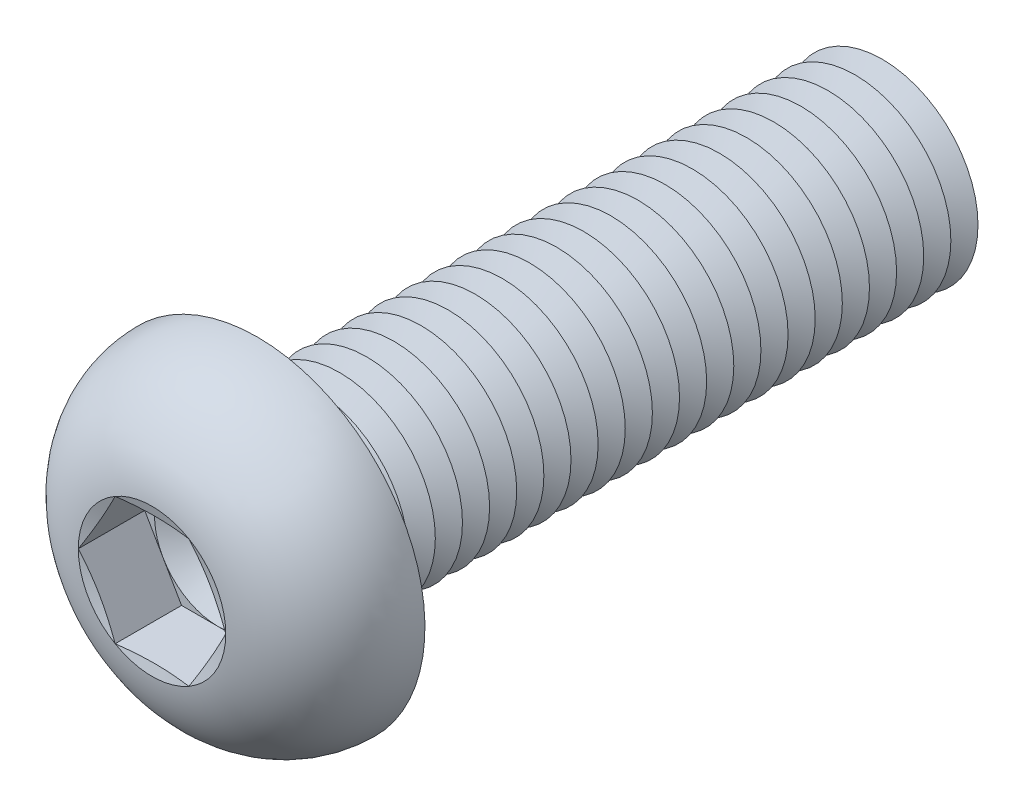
ISO-10303-21;
HEADER;
FILE_DESCRIPTION(('STEP AP214'),'2;1');
FILE_NAME('part.step','',(''),(''),'','','');
FILE_SCHEMA(('AUTOMOTIVE_DESIGN { 1 0 10303 214 1 1 1 1 }'));
ENDSEC;
DATA;
#1=APPLICATION_CONTEXT('core data for automotive mechanical design processes');
#2=APPLICATION_PROTOCOL_DEFINITION('international standard','automotive_design',2000,#1);
#3=PRODUCT_CONTEXT('',#1,'mechanical');
#4=PRODUCT('Part','Part','',(#3));
#5=PRODUCT_RELATED_PRODUCT_CATEGORY('part','',(#4));
#6=PRODUCT_DEFINITION_FORMATION('','',#4);
#7=PRODUCT_DEFINITION_CONTEXT('part definition',#1,'design');
#8=PRODUCT_DEFINITION('design','',#6,#7);
#9=PRODUCT_DEFINITION_SHAPE('','',#8);
#10=(LENGTH_UNIT() NAMED_UNIT(*) SI_UNIT(.MILLI.,.METRE.));
#11=(NAMED_UNIT(*) PLANE_ANGLE_UNIT() SI_UNIT($,.RADIAN.));
#12=(NAMED_UNIT(*) SI_UNIT($,.STERADIAN.) SOLID_ANGLE_UNIT());
#13=UNCERTAINTY_MEASURE_WITH_UNIT(LENGTH_MEASURE(1.E-05),#10,'distance_accuracy_value','');
#14=(GEOMETRIC_REPRESENTATION_CONTEXT(3) GLOBAL_UNCERTAINTY_ASSIGNED_CONTEXT((#13)) GLOBAL_UNIT_ASSIGNED_CONTEXT((#10,
#11,#12)) REPRESENTATION_CONTEXT('',''));
#15=CARTESIAN_POINT('',(0.,0.,0.));
#16=DIRECTION('',(0.,0.,1.));
#17=DIRECTION('',(1.,0.,0.));
#18=AXIS2_PLACEMENT_3D('',#15,#16,#17);
#19=CARTESIAN_POINT('',(0.,0.,2.43999999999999));
#20=DIRECTION('',(0.,0.,1.));
#21=DIRECTION('',(1.,0.,0.));
#22=AXIS2_PLACEMENT_3D('',#19,#20,#21);
#23=PLANE('',#22);
#24=CARTESIAN_POINT('',(0.,0.,2.43999999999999));
#25=DIRECTION('',(0.,0.,1.));
#26=DIRECTION('',(1.,0.,0.));
#27=AXIS2_PLACEMENT_3D('',#24,#25,#26);
#28=CIRCLE('',#27,3.99999813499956);
#29=CARTESIAN_POINT('',(3.4641,1.99999906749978,2.43999999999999));
#30=VERTEX_POINT('',#29);
#31=CARTESIAN_POINT('',(0.,3.99999813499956,2.43999999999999));
#32=VERTEX_POINT('',#31);
#33=EDGE_CURVE('E118',#30,#32,#28,.T.);
#34=ORIENTED_EDGE('',*,*,#33,.F.);
#35=DIRECTION('',(-0.5,0.866025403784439,0.));
#36=VECTOR('',#35,1.);
#37=CARTESIAN_POINT('',(4.6188,0.,2.43999999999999));
#38=LINE('',#37,#36);
#39=CARTESIAN_POINT('',(2.3094,3.99999813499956,2.43999999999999));
#40=VERTEX_POINT('',#39);
#41=EDGE_CURVE('E125',#30,#40,#38,.T.);
#42=ORIENTED_EDGE('',*,*,#41,.T.);
#43=DIRECTION('',(-1.,0.,0.));
#44=VECTOR('',#43,1.);
#45=CARTESIAN_POINT('',(2.3094,3.99999813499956,2.43999999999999));
#46=LINE('',#45,#44);
#47=EDGE_CURVE('E136',#40,#32,#46,.T.);
#48=ORIENTED_EDGE('',*,*,#47,.T.);
#49=EDGE_LOOP('',(#34,#42,#48));
#50=FACE_BOUND('',#49,.T.);
#51=ADVANCED_FACE('F39',(#50),#23,.T.);
#52=CARTESIAN_POINT('',(0.,0.,2.43999999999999));
#53=DIRECTION('',(0.,0.,1.));
#54=DIRECTION('',(1.,0.,0.));
#55=AXIS2_PLACEMENT_3D('',#52,#53,#54);
#56=CIRCLE('',#55,3.99999813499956);
#57=CARTESIAN_POINT('',(-3.4641,1.99999906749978,2.43999999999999));
#58=VERTEX_POINT('',#57);
#59=EDGE_CURVE('E11',#32,#58,#56,.T.);
#60=ORIENTED_EDGE('',*,*,#59,.F.);
#61=CARTESIAN_POINT('',(-2.3094,3.99999813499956,2.43999999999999));
#62=VERTEX_POINT('',#61);
#63=EDGE_CURVE('E131',#32,#62,#46,.T.);
#64=ORIENTED_EDGE('',*,*,#63,.T.);
#65=DIRECTION('',(-0.5,-0.866025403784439,0.));
#66=VECTOR('',#65,1.);
#67=CARTESIAN_POINT('',(-2.3094,3.99999813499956,2.43999999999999));
#68=LINE('',#67,#66);
#69=EDGE_CURVE('E134',#62,#58,#68,.T.);
#70=ORIENTED_EDGE('',*,*,#69,.T.);
#71=EDGE_LOOP('',(#60,#64,#70));
#72=FACE_BOUND('',#71,.T.);
#73=ADVANCED_FACE('F130',(#72),#23,.T.);
#74=CARTESIAN_POINT('',(-3.4641,-1.99999906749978,2.43999999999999));
#75=VERTEX_POINT('',#74);
#76=EDGE_CURVE('E49',#58,#75,#56,.T.);
#77=ORIENTED_EDGE('',*,*,#76,.F.);
#78=CARTESIAN_POINT('',(-4.6188,0.,2.43999999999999));
#79=VERTEX_POINT('',#78);
#80=EDGE_CURVE('E143',#58,#79,#68,.T.);
#81=ORIENTED_EDGE('',*,*,#80,.T.);
#82=DIRECTION('',(0.5,-0.866025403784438,0.));
#83=VECTOR('',#82,1.);
#84=CARTESIAN_POINT('',(-4.6188,0.,2.43999999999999));
#85=LINE('',#84,#83);
#86=EDGE_CURVE('E151',#79,#75,#85,.T.);
#87=ORIENTED_EDGE('',*,*,#86,.T.);
#88=EDGE_LOOP('',(#77,#81,#87));
#89=FACE_BOUND('',#88,.T.);
#90=ADVANCED_FACE('F455',(#89),#23,.T.);
#91=CARTESIAN_POINT('',(0.,-3.99999813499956,2.43999999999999));
#92=VERTEX_POINT('',#91);
#93=EDGE_CURVE('E440',#75,#92,#56,.T.);
#94=ORIENTED_EDGE('',*,*,#93,.F.);
#95=CARTESIAN_POINT('',(-2.3094,-3.99999813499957,2.43999999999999));
#96=VERTEX_POINT('',#95);
#97=EDGE_CURVE('E150',#75,#96,#85,.T.);
#98=ORIENTED_EDGE('',*,*,#97,.T.);
#99=DIRECTION('',(1.,0.,0.));
#100=VECTOR('',#99,1.);
#101=CARTESIAN_POINT('',(-2.3094,-3.99999813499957,2.43999999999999));
#102=LINE('',#101,#100);
#103=EDGE_CURVE('E156',#96,#92,#102,.T.);
#104=ORIENTED_EDGE('',*,*,#103,.T.);
#105=EDGE_LOOP('',(#94,#98,#104));
#106=FACE_BOUND('',#105,.T.);
#107=ADVANCED_FACE('F448',(#106),#23,.T.);
#108=CARTESIAN_POINT('',(3.4641,-1.99999906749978,2.43999999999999));
#109=VERTEX_POINT('',#108);
#110=EDGE_CURVE('E56',#92,#109,#56,.T.);
#111=ORIENTED_EDGE('',*,*,#110,.F.);
#112=CARTESIAN_POINT('',(2.3094,-3.99999813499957,2.43999999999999));
#113=VERTEX_POINT('',#112);
#114=EDGE_CURVE('E155',#92,#113,#102,.T.);
#115=ORIENTED_EDGE('',*,*,#114,.T.);
#116=DIRECTION('',(0.5,0.866025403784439,0.));
#117=VECTOR('',#116,1.);
#118=CARTESIAN_POINT('',(2.3094,-3.99999813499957,2.43999999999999));
#119=LINE('',#118,#117);
#120=EDGE_CURVE('E161',#113,#109,#119,.T.);
#121=ORIENTED_EDGE('',*,*,#120,.T.);
#122=EDGE_LOOP('',(#111,#115,#121));
#123=FACE_BOUND('',#122,.T.);
#124=ADVANCED_FACE('F525',(#123),#23,.T.);
#125=CARTESIAN_POINT('',(0.,0.,6.59999999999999));
#126=DIRECTION('',(0.,0.,1.));
#127=DIRECTION('',(0.,-1.,0.));
#128=AXIS2_PLACEMENT_3D('',#125,#126,#127);
#129=CONICAL_SURFACE('',#128,4.6188,1.30899693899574);
#130=CARTESIAN_POINT('',(4.61891547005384,-0.000200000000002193,6.6000309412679));
#131=CARTESIAN_POINT('',(4.52300232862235,0.165926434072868,6.57431944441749));
#132=CARTESIAN_POINT('',(4.42691527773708,0.332354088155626,6.55097758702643));
#133=CARTESIAN_POINT('',(4.23440181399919,0.665797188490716,6.50996805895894));
#134=CARTESIAN_POINT('',(4.13797527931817,0.83281284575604,6.49230269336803));
#135=CARTESIAN_POINT('',(3.94536752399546,1.16641926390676,6.46367750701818));
#136=CARTESIAN_POINT('',(3.84918760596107,1.33300776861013,6.45268354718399));
#137=CARTESIAN_POINT('',(3.6567051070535,1.66639723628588,6.4379417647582));
#138=CARTESIAN_POINT('',(3.56040255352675,1.83319815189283,6.43419253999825));
#139=CARTESIAN_POINT('',(3.36779744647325,2.16679998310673,6.43419253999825));
#140=CARTESIAN_POINT('',(3.2714948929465,2.33360089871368,6.4379417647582));
#141=CARTESIAN_POINT('',(3.07901239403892,2.66699036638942,6.45268354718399));
#142=CARTESIAN_POINT('',(2.98283247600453,2.8335788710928,6.46367750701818));
#143=CARTESIAN_POINT('',(2.79022472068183,3.16718528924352,6.49230269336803));
#144=CARTESIAN_POINT('',(2.69379818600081,3.33420094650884,6.50996805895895));
#145=CARTESIAN_POINT('',(2.50128472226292,3.66764404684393,6.55097758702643));
#146=CARTESIAN_POINT('',(2.40519767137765,3.83407170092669,6.57431944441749));
#147=CARTESIAN_POINT('',(2.30928452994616,4.00019813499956,6.6000309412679));
#148=B_SPLINE_CURVE_WITH_KNOTS('',3,(#130,#131,#132,#133,#134,#135,#136,#137,#138,#139,#140,
#141,#142,#143,#144,#145,#146,#147),.UNSPECIFIED.,.F.,.F.,(4,2,2,2,2,2,2,2,4),(0.,
0.580655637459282,1.16154676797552,1.73943971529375,2.31722080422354,2.89500189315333,
3.47289484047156,4.05378597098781,4.63444160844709),.UNSPECIFIED.);
#149=CARTESIAN_POINT('',(4.6188,0.,6.59999999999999));
#150=VERTEX_POINT('',#149);
#151=CARTESIAN_POINT('',(2.30940000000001,3.99999813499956,6.6));
#152=VERTEX_POINT('',#151);
#153=EDGE_CURVE('E221',#150,#152,#148,.T.);
#154=ORIENTED_EDGE('',*,*,#153,.F.);
#155=CARTESIAN_POINT('',(0.,0.,6.59999999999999));
#156=DIRECTION('',(0.,0.,-1.));
#157=DIRECTION('',(0.,1.,0.));
#158=AXIS2_PLACEMENT_3D('',#155,#156,#157);
#159=CIRCLE('',#158,4.6188);
#160=EDGE_CURVE('E420',#152,#150,#159,.T.);
#161=ORIENTED_EDGE('',*,*,#160,.F.);
#162=EDGE_LOOP('',(#154,#161));
#163=FACE_BOUND('',#162,.T.);
#164=ADVANCED_FACE('F529',(#163),#129,.F.);
#165=CARTESIAN_POINT('',(2.30928452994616,-4.00019813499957,6.6000309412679));
#166=CARTESIAN_POINT('',(2.40519767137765,-3.8340717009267,6.57431944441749));
#167=CARTESIAN_POINT('',(2.50128472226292,-3.66764404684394,6.55097758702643));
#168=CARTESIAN_POINT('',(2.69379818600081,-3.33420094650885,6.50996805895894));
#169=CARTESIAN_POINT('',(2.79022472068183,-3.16718528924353,6.49230269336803));
#170=CARTESIAN_POINT('',(2.98283247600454,-2.8335788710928,6.46367750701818));
#171=CARTESIAN_POINT('',(3.07901239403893,-2.66699036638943,6.45268354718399));
#172=CARTESIAN_POINT('',(3.2714948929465,-2.33360089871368,6.4379417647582));
#173=CARTESIAN_POINT('',(3.36779744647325,-2.16679998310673,6.43419253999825));
#174=CARTESIAN_POINT('',(3.56040255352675,-1.83319815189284,6.43419253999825));
#175=CARTESIAN_POINT('',(3.6567051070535,-1.66639723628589,6.4379417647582));
#176=CARTESIAN_POINT('',(3.84918760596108,-1.33300776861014,6.45268354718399));
#177=CARTESIAN_POINT('',(3.94536752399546,-1.16641926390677,6.46367750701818));
#178=CARTESIAN_POINT('',(4.13797527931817,-0.832812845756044,6.49230269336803));
#179=CARTESIAN_POINT('',(4.23440181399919,-0.66579718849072,6.50996805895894));
#180=CARTESIAN_POINT('',(4.42691527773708,-0.332354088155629,6.55097758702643));
#181=CARTESIAN_POINT('',(4.52300232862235,-0.165926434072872,6.57431944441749));
#182=CARTESIAN_POINT('',(4.61891547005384,0.000199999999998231,6.6000309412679));
#183=B_SPLINE_CURVE_WITH_KNOTS('',3,(#165,#166,#167,#168,#169,#170,#171,#172,#173,#174,#175,
#176,#177,#178,#179,#180,#181,#182),.UNSPECIFIED.,.F.,.F.,(4,2,2,2,2,2,2,2,4),(0.,
0.580655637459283,1.16154676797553,1.73943971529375,2.31722080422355,2.89500189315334,
3.47289484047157,4.05378597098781,4.63444160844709),.UNSPECIFIED.);
#184=CARTESIAN_POINT('',(2.3094,-3.99999813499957,6.59999999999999));
#185=VERTEX_POINT('',#184);
#186=EDGE_CURVE('E230',#185,#150,#183,.T.);
#187=ORIENTED_EDGE('',*,*,#186,.F.);
#188=EDGE_CURVE('E425',#150,#185,#159,.T.);
#189=ORIENTED_EDGE('',*,*,#188,.F.);
#190=EDGE_LOOP('',(#187,#189));
#191=FACE_BOUND('',#190,.T.);
#192=ADVANCED_FACE('F490',(#191),#129,.F.);
#193=CARTESIAN_POINT('',(-6.96966750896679,-3.99999813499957,7.51561854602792));
#194=CARTESIAN_POINT('',(-6.80094634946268,-3.99999813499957,7.47641178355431));
#195=CARTESIAN_POINT('',(-6.63214895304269,-3.99999813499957,7.43753277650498));
#196=CARTESIAN_POINT('',(-6.29436999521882,-3.99999813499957,7.36057075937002));
#197=CARTESIAN_POINT('',(-6.12538843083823,-3.99999813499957,7.3224877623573));
#198=CARTESIAN_POINT('',(-5.61806276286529,-3.99999813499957,7.20963087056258));
#199=CARTESIAN_POINT('',(-5.27940301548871,-3.99999813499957,7.13626437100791));
#200=CARTESIAN_POINT('',(-4.5977576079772,-3.99999813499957,6.99431141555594));
#201=CARTESIAN_POINT('',(-4.25476115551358,-3.99999813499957,6.92577621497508));
#202=CARTESIAN_POINT('',(-3.56716783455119,-3.99999813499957,6.79696563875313));
#203=CARTESIAN_POINT('',(-3.22257082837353,-3.99999813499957,6.73669098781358));
#204=CARTESIAN_POINT('',(-2.54069952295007,-3.99999813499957,6.63002020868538));
#205=CARTESIAN_POINT('',(-2.20347918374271,-3.99999813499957,6.58329286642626));
#206=CARTESIAN_POINT('',(-1.6962445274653,-3.99999813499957,6.52585827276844));
#207=CARTESIAN_POINT('',(-1.52694760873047,-3.99999813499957,6.50882377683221));
#208=CARTESIAN_POINT('',(-1.187938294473,-3.99999813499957,6.47963274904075));
#209=CARTESIAN_POINT('',(-1.01822592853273,-3.99999813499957,6.4674758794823));
#210=CARTESIAN_POINT('',(-0.679233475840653,-3.99999813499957,6.44863176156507));
#211=CARTESIAN_POINT('',(-0.509954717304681,-3.99999813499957,6.44192096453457));
#212=CARTESIAN_POINT('',(-0.171265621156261,-3.99999813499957,6.43422163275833));
#213=CARTESIAN_POINT('',(-0.00185528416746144,-3.99999813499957,6.43323307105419));
#214=CARTESIAN_POINT('',(0.336912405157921,-3.99999813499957,6.43703123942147));
#215=CARTESIAN_POINT('',(0.506269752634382,-3.99999813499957,6.44181839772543));
#216=CARTESIAN_POINT('',(0.844732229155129,-3.99999813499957,6.45691823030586));
#217=CARTESIAN_POINT('',(1.0138373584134,-3.99999813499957,6.46723089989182));
#218=CARTESIAN_POINT('',(1.4244995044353,-3.99999813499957,6.49843349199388));
#219=CARTESIAN_POINT('',(1.66585565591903,-3.99999813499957,6.52196685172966));
#220=CARTESIAN_POINT('',(2.14755410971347,-3.99999813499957,6.57749710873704));
#221=CARTESIAN_POINT('',(2.3878964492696,-3.99999813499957,6.60949369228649));
#222=CARTESIAN_POINT('',(2.86835569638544,-3.99999813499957,6.68017769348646));
#223=CARTESIAN_POINT('',(3.10846949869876,-3.99999813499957,6.71888590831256));
#224=CARTESIAN_POINT('',(3.5878341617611,-3.99999813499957,6.80132981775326));
#225=CARTESIAN_POINT('',(3.82708497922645,-3.99999813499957,6.84506576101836));
#226=CARTESIAN_POINT('',(4.30977392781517,-3.99999813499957,6.93726543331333));
#227=CARTESIAN_POINT('',(4.55319689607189,-3.99999813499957,6.98580793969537));
#228=CARTESIAN_POINT('',(5.03943022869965,-3.99999813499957,7.08586668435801));
#229=CARTESIAN_POINT('',(5.28224058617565,-3.99999813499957,7.13738295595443));
#230=CARTESIAN_POINT('',(5.76604885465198,-3.99999813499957,7.24238429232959));
#231=CARTESIAN_POINT('',(6.00704943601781,-3.99999813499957,7.29585711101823));
#232=CARTESIAN_POINT('',(6.48863948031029,-3.99999813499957,7.4045482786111));
#233=CARTESIAN_POINT('',(6.72922897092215,-3.99999813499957,7.45976650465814));
#234=CARTESIAN_POINT('',(6.9696675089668,-3.99999813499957,7.51561854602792));
#235=B_SPLINE_CURVE_WITH_KNOTS('',3,(#193,#194,#195,#196,#197,#198,#199,#200,#201,#202,#203,
#204,#205,#206,#207,#208,#209,#210,#211,#212,#213,#214,#215,#216,#217,#218,#219,#220,#221,#222,
#223,#224,#225,#226,#227,#228,#229,#230,#231,#232,#233,#234),.UNSPECIFIED.,.F.,.F.,(4,2,2,2,2,2,
2,2,2,2,2,2,2,2,2,2,2,2,2,2,4),(0.,0.519649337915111,1.03930720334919,2.07882421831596,
3.12808572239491,4.17743921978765,5.19841727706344,5.7088142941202,6.21917596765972,
6.7273189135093,7.23545946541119,7.74363769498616,8.25181549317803,8.9791183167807,
9.7063941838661,10.4359652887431,11.1655724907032,11.910195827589,12.6548275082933,
13.395405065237,14.1359306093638),.UNSPECIFIED.);
#236=CARTESIAN_POINT('',(-2.3094,-3.99999813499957,6.59999999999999));
#237=VERTEX_POINT('',#236);
#238=EDGE_CURVE('E469',#237,#185,#235,.T.);
#239=ORIENTED_EDGE('',*,*,#238,.F.);
#240=EDGE_CURVE('E482',#185,#237,#159,.T.);
#241=ORIENTED_EDGE('',*,*,#240,.F.);
#242=EDGE_LOOP('',(#239,#241));
#243=FACE_BOUND('',#242,.T.);
#244=ADVANCED_FACE('F496',(#243),#129,.F.);
#245=CARTESIAN_POINT('',(-4.61891547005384,0.000199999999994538,6.6000309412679));
#246=CARTESIAN_POINT('',(-4.52300232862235,-0.165926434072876,6.57431944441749));
#247=CARTESIAN_POINT('',(-4.42691527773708,-0.332354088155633,6.55097758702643));
#248=CARTESIAN_POINT('',(-4.23440181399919,-0.665797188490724,6.50996805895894));
#249=CARTESIAN_POINT('',(-4.13797527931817,-0.832812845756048,6.49230269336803));
#250=CARTESIAN_POINT('',(-3.94536752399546,-1.16641926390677,6.46367750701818));
#251=CARTESIAN_POINT('',(-3.84918760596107,-1.33300776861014,6.45268354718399));
#252=CARTESIAN_POINT('',(-3.6567051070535,-1.66639723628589,6.4379417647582));
#253=CARTESIAN_POINT('',(-3.56040255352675,-1.83319815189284,6.43419253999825));
#254=CARTESIAN_POINT('',(-3.36779744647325,-2.16679998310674,6.43419253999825));
#255=CARTESIAN_POINT('',(-3.2714948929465,-2.33360089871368,6.4379417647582));
#256=CARTESIAN_POINT('',(-3.07901239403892,-2.66699036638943,6.45268354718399));
#257=CARTESIAN_POINT('',(-2.98283247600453,-2.83357887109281,6.46367750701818));
#258=CARTESIAN_POINT('',(-2.79022472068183,-3.16718528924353,6.49230269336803));
#259=CARTESIAN_POINT('',(-2.69379818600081,-3.33420094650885,6.50996805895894));
#260=CARTESIAN_POINT('',(-2.50128472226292,-3.66764404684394,6.55097758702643));
#261=CARTESIAN_POINT('',(-2.40519767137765,-3.8340717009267,6.57431944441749));
#262=CARTESIAN_POINT('',(-2.30928452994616,-4.00019813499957,6.60003094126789));
#263=B_SPLINE_CURVE_WITH_KNOTS('',3,(#245,#246,#247,#248,#249,#250,#251,#252,#253,#254,#255,
#256,#257,#258,#259,#260,#261,#262),.UNSPECIFIED.,.F.,.F.,(4,2,2,2,2,2,2,2,4),(0.,
0.580655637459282,1.16154676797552,1.73943971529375,2.31722080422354,2.89500189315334,
3.47289484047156,4.05378597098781,4.63444160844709),.UNSPECIFIED.);
#264=CARTESIAN_POINT('',(-4.6188,0.,6.59999999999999));
#265=VERTEX_POINT('',#264);
#266=EDGE_CURVE('E460',#265,#237,#263,.T.);
#267=ORIENTED_EDGE('',*,*,#266,.F.);
#268=EDGE_CURVE('E466',#237,#265,#159,.T.);
#269=ORIENTED_EDGE('',*,*,#268,.F.);
#270=EDGE_LOOP('',(#267,#269));
#271=FACE_BOUND('',#270,.T.);
#272=ADVANCED_FACE('F464',(#271),#129,.F.);
#273=CARTESIAN_POINT('',(-2.30928452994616,4.00019813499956,6.6000309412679));
#274=CARTESIAN_POINT('',(-2.40519767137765,3.83407170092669,6.57431944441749));
#275=CARTESIAN_POINT('',(-2.50128472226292,3.66764404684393,6.55097758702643));
#276=CARTESIAN_POINT('',(-2.69379818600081,3.33420094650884,6.50996805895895));
#277=CARTESIAN_POINT('',(-2.79022472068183,3.16718528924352,6.49230269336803));
#278=CARTESIAN_POINT('',(-2.98283247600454,2.8335788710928,6.46367750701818));
#279=CARTESIAN_POINT('',(-3.07901239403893,2.66699036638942,6.45268354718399));
#280=CARTESIAN_POINT('',(-3.2714948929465,2.33360089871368,6.4379417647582));
#281=CARTESIAN_POINT('',(-3.36779744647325,2.16679998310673,6.43419253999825));
#282=CARTESIAN_POINT('',(-3.56040255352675,1.83319815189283,6.43419253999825));
#283=CARTESIAN_POINT('',(-3.6567051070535,1.66639723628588,6.4379417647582));
#284=CARTESIAN_POINT('',(-3.84918760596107,1.33300776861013,6.45268354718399));
#285=CARTESIAN_POINT('',(-3.94536752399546,1.16641926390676,6.46367750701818));
#286=CARTESIAN_POINT('',(-4.13797527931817,0.832812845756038,6.49230269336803));
#287=CARTESIAN_POINT('',(-4.23440181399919,0.665797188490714,6.50996805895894));
#288=CARTESIAN_POINT('',(-4.42691527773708,0.332354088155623,6.55097758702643));
#289=CARTESIAN_POINT('',(-4.52300232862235,0.165926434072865,6.57431944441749));
#290=CARTESIAN_POINT('',(-4.61891547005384,-0.000200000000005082,6.6000309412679));
#291=B_SPLINE_CURVE_WITH_KNOTS('',3,(#273,#274,#275,#276,#277,#278,#279,#280,#281,#282,#283,
#284,#285,#286,#287,#288,#289,#290),.UNSPECIFIED.,.F.,.F.,(4,2,2,2,2,2,2,2,4),(0.,
0.580655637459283,1.16154676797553,1.73943971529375,2.31722080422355,2.89500189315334,
3.47289484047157,4.05378597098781,4.63444160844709),.UNSPECIFIED.);
#292=CARTESIAN_POINT('',(-2.3094,3.99999813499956,6.59999999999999));
#293=VERTEX_POINT('',#292);
#294=EDGE_CURVE('E194',#293,#265,#291,.T.);
#295=ORIENTED_EDGE('',*,*,#294,.F.);
#296=EDGE_CURVE('E472',#265,#293,#159,.T.);
#297=ORIENTED_EDGE('',*,*,#296,.F.);
#298=EDGE_LOOP('',(#295,#297));
#299=FACE_BOUND('',#298,.T.);
#300=ADVANCED_FACE('F473',(#299),#129,.F.);
#301=CARTESIAN_POINT('',(0.,0.,-34.05));
#302=DIRECTION('',(0.,0.,1.));
#303=DIRECTION('',(0.,-1.,0.));
#304=AXIS2_PLACEMENT_3D('',#301,#302,#303);
#305=CONICAL_SURFACE('',#304,5.99999999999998,1.0471975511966);
#306=CARTESIAN_POINT('',(0.,0.,-34.9));
#307=DIRECTION('',(0.,0.,1.));
#308=DIRECTION('',(0.,-1.,0.));
#309=AXIS2_PLACEMENT_3D('',#306,#307,#308);
#310=CIRCLE('',#309,4.52775681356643);
#311=CARTESIAN_POINT('',(0.,-4.52775681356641,-34.9));
#312=VERTEX_POINT('',#311);
#313=EDGE_CURVE('E391',#312,#312,#310,.T.);
#314=ORIENTED_EDGE('',*,*,#313,.T.);
#315=EDGE_LOOP('',(#314));
#316=FACE_BOUND('',#315,.T.);
#317=CARTESIAN_POINT('',(0.,0.,-34.05));
#318=DIRECTION('',(0.,0.,1.));
#319=DIRECTION('',(0.,-1.,0.));
#320=AXIS2_PLACEMENT_3D('',#317,#318,#319);
#321=CIRCLE('',#320,5.99999999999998);
#322=CARTESIAN_POINT('',(0.,-5.99999999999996,-34.05));
#323=VERTEX_POINT('',#322);
#324=EDGE_CURVE('E387',#323,#323,#321,.T.);
#325=ORIENTED_EDGE('',*,*,#324,.F.);
#326=EDGE_LOOP('',(#325));
#327=FACE_BOUND('',#326,.T.);
#328=ADVANCED_FACE('F557',(#316,#327),#305,.T.);
#329=CARTESIAN_POINT('',(0.,0.,-34.9));
#330=DIRECTION('',(0.,0.,-1.));
#331=DIRECTION('',(0.,1.,0.));
#332=AXIS2_PLACEMENT_3D('',#329,#330,#331);
#333=CONICAL_SURFACE('',#332,4.52775681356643,1.0471975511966);
#334=CARTESIAN_POINT('',(0.,0.,-35.75));
#335=DIRECTION('',(0.,0.,1.));
#336=DIRECTION('',(0.,-1.,0.));
#337=AXIS2_PLACEMENT_3D('',#334,#335,#336);
#338=CIRCLE('',#337,5.99999999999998);
#339=CARTESIAN_POINT('',(0.,-5.99999999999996,-35.75));
#340=VERTEX_POINT('',#339);
#341=EDGE_CURVE('E395',#340,#340,#338,.T.);
#342=ORIENTED_EDGE('',*,*,#341,.T.);
#343=EDGE_LOOP('',(#342));
#344=FACE_BOUND('',#343,.T.);
#345=ORIENTED_EDGE('',*,*,#313,.F.);
#346=EDGE_LOOP('',(#345));
#347=FACE_BOUND('',#346,.T.);
#348=ADVANCED_FACE('F562',(#344,#347),#333,.T.);
#349=CARTESIAN_POINT('',(0.,6.,-40.));
#350=DIRECTION('',(0.,0.,-1.));
#351=DIRECTION('',(0.,1.,0.));
#352=AXIS2_PLACEMENT_3D('',#349,#350,#351);
#353=PLANE('',#352);
#354=CARTESIAN_POINT('',(0.,0.,-40.));
#355=DIRECTION('',(0.,0.,1.));
#356=DIRECTION('',(0.,-1.,0.));
#357=AXIS2_PLACEMENT_3D('',#354,#355,#356);
#358=CIRCLE('',#357,4.52775681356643);
#359=CARTESIAN_POINT('',(0.,-4.52775681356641,-40.));
#360=VERTEX_POINT('',#359);
#361=EDGE_CURVE('E415',#360,#360,#358,.T.);
#362=ORIENTED_EDGE('',*,*,#361,.F.);
#363=EDGE_LOOP('',(#362));
#364=FACE_BOUND('',#363,.T.);
#365=ADVANCED_FACE('F737',(#364),#353,.T.);
#366=CARTESIAN_POINT('',(0.,0.,-39.15));
#367=DIRECTION('',(0.,0.,1.));
#368=DIRECTION('',(0.,-1.,0.));
#369=AXIS2_PLACEMENT_3D('',#366,#367,#368);
#370=CONICAL_SURFACE('',#369,5.99999999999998,1.0471975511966);
#371=ORIENTED_EDGE('',*,*,#361,.T.);
#372=EDGE_LOOP('',(#371));
#373=FACE_BOUND('',#372,.T.);
#374=CARTESIAN_POINT('',(0.,0.,-39.15));
#375=DIRECTION('',(0.,0.,1.));
#376=DIRECTION('',(0.,-1.,0.));
#377=AXIS2_PLACEMENT_3D('',#374,#375,#376);
#378=CIRCLE('',#377,5.99999999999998);
#379=CARTESIAN_POINT('',(0.,-5.99999999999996,-39.15));
#380=VERTEX_POINT('',#379);
#381=EDGE_CURVE('E411',#380,#380,#378,.T.);
#382=ORIENTED_EDGE('',*,*,#381,.F.);
#383=EDGE_LOOP('',(#382));
#384=FACE_BOUND('',#383,.T.);
#385=ADVANCED_FACE('F730',(#373,#384),#370,.T.);
#386=CARTESIAN_POINT('',(0.,0.,-38.3));
#387=DIRECTION('',(0.,0.,-1.));
#388=DIRECTION('',(0.,1.,0.));
#389=AXIS2_PLACEMENT_3D('',#386,#387,#388);
#390=CONICAL_SURFACE('',#389,4.52775681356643,1.0471975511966);
#391=ORIENTED_EDGE('',*,*,#381,.T.);
#392=EDGE_LOOP('',(#391));
#393=FACE_BOUND('',#392,.T.);
#394=CARTESIAN_POINT('',(0.,0.,-38.3));
#395=DIRECTION('',(0.,0.,1.));
#396=DIRECTION('',(0.,-1.,0.));
#397=AXIS2_PLACEMENT_3D('',#394,#395,#396);
#398=CIRCLE('',#397,4.52775681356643);
#399=CARTESIAN_POINT('',(0.,-4.52775681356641,-38.3));
#400=VERTEX_POINT('',#399);
#401=EDGE_CURVE('E407',#400,#400,#398,.T.);
#402=ORIENTED_EDGE('',*,*,#401,.F.);
#403=EDGE_LOOP('',(#402));
#404=FACE_BOUND('',#403,.T.);
#405=ADVANCED_FACE('F736',(#393,#404),#390,.T.);
#406=CARTESIAN_POINT('',(0.,0.,-37.45));
#407=DIRECTION('',(0.,0.,1.));
#408=DIRECTION('',(0.,-1.,0.));
#409=AXIS2_PLACEMENT_3D('',#406,#407,#408);
#410=CONICAL_SURFACE('',#409,5.99999999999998,1.0471975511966);
#411=ORIENTED_EDGE('',*,*,#401,.T.);
#412=EDGE_LOOP('',(#411));
#413=FACE_BOUND('',#412,.T.);
#414=CARTESIAN_POINT('',(0.,0.,-37.45));
#415=DIRECTION('',(0.,0.,1.));
#416=DIRECTION('',(0.,-1.,0.));
#417=AXIS2_PLACEMENT_3D('',#414,#415,#416);
#418=CIRCLE('',#417,5.99999999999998);
#419=CARTESIAN_POINT('',(0.,-5.99999999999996,-37.45));
#420=VERTEX_POINT('',#419);
#421=EDGE_CURVE('E403',#420,#420,#418,.T.);
#422=ORIENTED_EDGE('',*,*,#421,.F.);
#423=EDGE_LOOP('',(#422));
#424=FACE_BOUND('',#423,.T.);
#425=ADVANCED_FACE('F768',(#413,#424),#410,.T.);
#426=CARTESIAN_POINT('',(0.,0.,-36.6));
#427=DIRECTION('',(0.,0.,-1.));
#428=DIRECTION('',(0.,1.,0.));
#429=AXIS2_PLACEMENT_3D('',#426,#427,#428);
#430=CONICAL_SURFACE('',#429,4.52775681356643,1.0471975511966);
#431=ORIENTED_EDGE('',*,*,#421,.T.);
#432=EDGE_LOOP('',(#431));
#433=FACE_BOUND('',#432,.T.);
#434=CARTESIAN_POINT('',(0.,0.,-36.6));
#435=DIRECTION('',(0.,0.,1.));
#436=DIRECTION('',(0.,-1.,0.));
#437=AXIS2_PLACEMENT_3D('',#434,#435,#436);
#438=CIRCLE('',#437,4.52775681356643);
#439=CARTESIAN_POINT('',(0.,-4.52775681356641,-36.6));
#440=VERTEX_POINT('',#439);
#441=EDGE_CURVE('E399',#440,#440,#438,.T.);
#442=ORIENTED_EDGE('',*,*,#441,.F.);
#443=EDGE_LOOP('',(#442));
#444=FACE_BOUND('',#443,.T.);
#445=ADVANCED_FACE('F778',(#433,#444),#430,.T.);
#446=CARTESIAN_POINT('',(0.,0.,-35.75));
#447=DIRECTION('',(0.,0.,1.));
#448=DIRECTION('',(0.,-1.,0.));
#449=AXIS2_PLACEMENT_3D('',#446,#447,#448);
#450=CONICAL_SURFACE('',#449,5.99999999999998,1.0471975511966);
#451=ORIENTED_EDGE('',*,*,#441,.T.);
#452=EDGE_LOOP('',(#451));
#453=FACE_BOUND('',#452,.T.);
#454=ORIENTED_EDGE('',*,*,#341,.F.);
#455=EDGE_LOOP('',(#454));
#456=FACE_BOUND('',#455,.T.);
#457=ADVANCED_FACE('F788',(#453,#456),#450,.T.);
#458=CARTESIAN_POINT('',(0.,0.,-32.35));
#459=DIRECTION('',(0.,0.,1.));
#460=DIRECTION('',(0.,-1.,0.));
#461=AXIS2_PLACEMENT_3D('',#458,#459,#460);
#462=CONICAL_SURFACE('',#461,5.99999999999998,1.0471975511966);
#463=CARTESIAN_POINT('',(0.,0.,-33.2));
#464=DIRECTION('',(0.,0.,1.));
#465=DIRECTION('',(0.,-1.,0.));
#466=AXIS2_PLACEMENT_3D('',#463,#464,#465);
#467=CIRCLE('',#466,4.52775681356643);
#468=CARTESIAN_POINT('',(0.,-4.52775681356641,-33.2));
#469=VERTEX_POINT('',#468);
#470=EDGE_CURVE('E383',#469,#469,#467,.T.);
#471=ORIENTED_EDGE('',*,*,#470,.T.);
#472=EDGE_LOOP('',(#471));
#473=FACE_BOUND('',#472,.T.);
#474=CARTESIAN_POINT('',(0.,0.,-32.35));
#475=DIRECTION('',(0.,0.,1.));
#476=DIRECTION('',(0.,-1.,0.));
#477=AXIS2_PLACEMENT_3D('',#474,#475,#476);
#478=CIRCLE('',#477,5.99999999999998);
#479=CARTESIAN_POINT('',(0.,-5.99999999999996,-32.35));
#480=VERTEX_POINT('',#479);
#481=EDGE_CURVE('E379',#480,#480,#478,.T.);
#482=ORIENTED_EDGE('',*,*,#481,.F.);
#483=EDGE_LOOP('',(#482));
#484=FACE_BOUND('',#483,.T.);
#485=ADVANCED_FACE('F798',(#473,#484),#462,.T.);
#486=CARTESIAN_POINT('',(0.,0.,-33.2));
#487=DIRECTION('',(0.,0.,-1.));
#488=DIRECTION('',(0.,1.,0.));
#489=AXIS2_PLACEMENT_3D('',#486,#487,#488);
#490=CONICAL_SURFACE('',#489,4.52775681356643,1.0471975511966);
#491=ORIENTED_EDGE('',*,*,#324,.T.);
#492=EDGE_LOOP('',(#491));
#493=FACE_BOUND('',#492,.T.);
#494=ORIENTED_EDGE('',*,*,#470,.F.);
#495=EDGE_LOOP('',(#494));
#496=FACE_BOUND('',#495,.T.);
#497=ADVANCED_FACE('F808',(#493,#496),#490,.T.);
#498=CARTESIAN_POINT('',(0.,0.,-30.65));
#499=DIRECTION('',(0.,0.,1.));
#500=DIRECTION('',(0.,-1.,0.));
#501=AXIS2_PLACEMENT_3D('',#498,#499,#500);
#502=CONICAL_SURFACE('',#501,5.99999999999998,1.0471975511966);
#503=CARTESIAN_POINT('',(0.,0.,-31.5));
#504=DIRECTION('',(0.,0.,1.));
#505=DIRECTION('',(0.,-1.,0.));
#506=AXIS2_PLACEMENT_3D('',#503,#504,#505);
#507=CIRCLE('',#506,4.52775681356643);
#508=CARTESIAN_POINT('',(0.,-4.52775681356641,-31.5));
#509=VERTEX_POINT('',#508);
#510=EDGE_CURVE('E375',#509,#509,#507,.T.);
#511=ORIENTED_EDGE('',*,*,#510,.T.);
#512=EDGE_LOOP('',(#511));
#513=FACE_BOUND('',#512,.T.);
#514=CARTESIAN_POINT('',(0.,0.,-30.65));
#515=DIRECTION('',(0.,0.,1.));
#516=DIRECTION('',(0.,-1.,0.));
#517=AXIS2_PLACEMENT_3D('',#514,#515,#516);
#518=CIRCLE('',#517,5.99999999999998);
#519=CARTESIAN_POINT('',(0.,-5.99999999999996,-30.65));
#520=VERTEX_POINT('',#519);
#521=EDGE_CURVE('E371',#520,#520,#518,.T.);
#522=ORIENTED_EDGE('',*,*,#521,.F.);
#523=EDGE_LOOP('',(#522));
#524=FACE_BOUND('',#523,.T.);
#525=ADVANCED_FACE('F818',(#513,#524),#502,.T.);
#526=CARTESIAN_POINT('',(0.,0.,-31.5));
#527=DIRECTION('',(0.,0.,-1.));
#528=DIRECTION('',(0.,1.,0.));
#529=AXIS2_PLACEMENT_3D('',#526,#527,#528);
#530=CONICAL_SURFACE('',#529,4.52775681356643,1.0471975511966);
#531=ORIENTED_EDGE('',*,*,#481,.T.);
#532=EDGE_LOOP('',(#531));
#533=FACE_BOUND('',#532,.T.);
#534=ORIENTED_EDGE('',*,*,#510,.F.);
#535=EDGE_LOOP('',(#534));
#536=FACE_BOUND('',#535,.T.);
#537=ADVANCED_FACE('F828',(#533,#536),#530,.T.);
#538=CARTESIAN_POINT('',(0.,0.,-28.95));
#539=DIRECTION('',(0.,0.,1.));
#540=DIRECTION('',(0.,-1.,0.));
#541=AXIS2_PLACEMENT_3D('',#538,#539,#540);
#542=CONICAL_SURFACE('',#541,5.99999999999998,1.0471975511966);
#543=CARTESIAN_POINT('',(0.,0.,-29.8));
#544=DIRECTION('',(0.,0.,1.));
#545=DIRECTION('',(0.,-1.,0.));
#546=AXIS2_PLACEMENT_3D('',#543,#544,#545);
#547=CIRCLE('',#546,4.52775681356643);
#548=CARTESIAN_POINT('',(0.,-4.52775681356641,-29.8));
#549=VERTEX_POINT('',#548);
#550=EDGE_CURVE('E367',#549,#549,#547,.T.);
#551=ORIENTED_EDGE('',*,*,#550,.T.);
#552=EDGE_LOOP('',(#551));
#553=FACE_BOUND('',#552,.T.);
#554=CARTESIAN_POINT('',(0.,0.,-28.95));
#555=DIRECTION('',(0.,0.,1.));
#556=DIRECTION('',(0.,-1.,0.));
#557=AXIS2_PLACEMENT_3D('',#554,#555,#556);
#558=CIRCLE('',#557,5.99999999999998);
#559=CARTESIAN_POINT('',(0.,-5.99999999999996,-28.95));
#560=VERTEX_POINT('',#559);
#561=EDGE_CURVE('E363',#560,#560,#558,.T.);
#562=ORIENTED_EDGE('',*,*,#561,.F.);
#563=EDGE_LOOP('',(#562));
#564=FACE_BOUND('',#563,.T.);
#565=ADVANCED_FACE('F838',(#553,#564),#542,.T.);
#566=CARTESIAN_POINT('',(0.,0.,-29.8));
#567=DIRECTION('',(0.,0.,-1.));
#568=DIRECTION('',(0.,1.,0.));
#569=AXIS2_PLACEMENT_3D('',#566,#567,#568);
#570=CONICAL_SURFACE('',#569,4.52775681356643,1.0471975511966);
#571=ORIENTED_EDGE('',*,*,#521,.T.);
#572=EDGE_LOOP('',(#571));
#573=FACE_BOUND('',#572,.T.);
#574=ORIENTED_EDGE('',*,*,#550,.F.);
#575=EDGE_LOOP('',(#574));
#576=FACE_BOUND('',#575,.T.);
#577=ADVANCED_FACE('F848',(#573,#576),#570,.T.);
#578=CARTESIAN_POINT('',(0.,0.,-27.25));
#579=DIRECTION('',(0.,0.,1.));
#580=DIRECTION('',(0.,-1.,0.));
#581=AXIS2_PLACEMENT_3D('',#578,#579,#580);
#582=CONICAL_SURFACE('',#581,5.99999999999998,1.0471975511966);
#583=CARTESIAN_POINT('',(0.,0.,-28.1));
#584=DIRECTION('',(0.,0.,1.));
#585=DIRECTION('',(0.,-1.,0.));
#586=AXIS2_PLACEMENT_3D('',#583,#584,#585);
#587=CIRCLE('',#586,4.52775681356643);
#588=CARTESIAN_POINT('',(0.,-4.52775681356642,-28.1));
#589=VERTEX_POINT('',#588);
#590=EDGE_CURVE('E359',#589,#589,#587,.T.);
#591=ORIENTED_EDGE('',*,*,#590,.T.);
#592=EDGE_LOOP('',(#591));
#593=FACE_BOUND('',#592,.T.);
#594=CARTESIAN_POINT('',(0.,0.,-27.25));
#595=DIRECTION('',(0.,0.,1.));
#596=DIRECTION('',(0.,-1.,0.));
#597=AXIS2_PLACEMENT_3D('',#594,#595,#596);
#598=CIRCLE('',#597,5.99999999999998);
#599=CARTESIAN_POINT('',(0.,-5.99999999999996,-27.25));
#600=VERTEX_POINT('',#599);
#601=EDGE_CURVE('E355',#600,#600,#598,.T.);
#602=ORIENTED_EDGE('',*,*,#601,.F.);
#603=EDGE_LOOP('',(#602));
#604=FACE_BOUND('',#603,.T.);
#605=ADVANCED_FACE('F858',(#593,#604),#582,.T.);
#606=CARTESIAN_POINT('',(0.,0.,-28.1));
#607=DIRECTION('',(0.,0.,-1.));
#608=DIRECTION('',(0.,1.,0.));
#609=AXIS2_PLACEMENT_3D('',#606,#607,#608);
#610=CONICAL_SURFACE('',#609,4.52775681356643,1.0471975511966);
#611=ORIENTED_EDGE('',*,*,#561,.T.);
#612=EDGE_LOOP('',(#611));
#613=FACE_BOUND('',#612,.T.);
#614=ORIENTED_EDGE('',*,*,#590,.F.);
#615=EDGE_LOOP('',(#614));
#616=FACE_BOUND('',#615,.T.);
#617=ADVANCED_FACE('F868',(#613,#616),#610,.T.);
#618=CARTESIAN_POINT('',(0.,0.,-25.55));
#619=DIRECTION('',(0.,0.,1.));
#620=DIRECTION('',(0.,-1.,0.));
#621=AXIS2_PLACEMENT_3D('',#618,#619,#620);
#622=CONICAL_SURFACE('',#621,5.99999999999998,1.0471975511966);
#623=CARTESIAN_POINT('',(0.,0.,-26.4));
#624=DIRECTION('',(0.,0.,1.));
#625=DIRECTION('',(0.,-1.,0.));
#626=AXIS2_PLACEMENT_3D('',#623,#624,#625);
#627=CIRCLE('',#626,4.52775681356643);
#628=CARTESIAN_POINT('',(0.,-4.52775681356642,-26.4));
#629=VERTEX_POINT('',#628);
#630=EDGE_CURVE('E351',#629,#629,#627,.T.);
#631=ORIENTED_EDGE('',*,*,#630,.T.);
#632=EDGE_LOOP('',(#631));
#633=FACE_BOUND('',#632,.T.);
#634=CARTESIAN_POINT('',(0.,0.,-25.55));
#635=DIRECTION('',(0.,0.,1.));
#636=DIRECTION('',(0.,-1.,0.));
#637=AXIS2_PLACEMENT_3D('',#634,#635,#636);
#638=CIRCLE('',#637,5.99999999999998);
#639=CARTESIAN_POINT('',(0.,-5.99999999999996,-25.55));
#640=VERTEX_POINT('',#639);
#641=EDGE_CURVE('E347',#640,#640,#638,.T.);
#642=ORIENTED_EDGE('',*,*,#641,.F.);
#643=EDGE_LOOP('',(#642));
#644=FACE_BOUND('',#643,.T.);
#645=ADVANCED_FACE('F878',(#633,#644),#622,.T.);
#646=CARTESIAN_POINT('',(0.,0.,-26.4));
#647=DIRECTION('',(0.,0.,-1.));
#648=DIRECTION('',(0.,1.,0.));
#649=AXIS2_PLACEMENT_3D('',#646,#647,#648);
#650=CONICAL_SURFACE('',#649,4.52775681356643,1.0471975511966);
#651=ORIENTED_EDGE('',*,*,#601,.T.);
#652=EDGE_LOOP('',(#651));
#653=FACE_BOUND('',#652,.T.);
#654=ORIENTED_EDGE('',*,*,#630,.F.);
#655=EDGE_LOOP('',(#654));
#656=FACE_BOUND('',#655,.T.);
#657=ADVANCED_FACE('F888',(#653,#656),#650,.T.);
#658=CARTESIAN_POINT('',(0.,0.,-23.85));
#659=DIRECTION('',(0.,0.,1.));
#660=DIRECTION('',(0.,-1.,0.));
#661=AXIS2_PLACEMENT_3D('',#658,#659,#660);
#662=CONICAL_SURFACE('',#661,5.99999999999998,1.0471975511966);
#663=CARTESIAN_POINT('',(0.,0.,-24.7));
#664=DIRECTION('',(0.,0.,1.));
#665=DIRECTION('',(0.,-1.,0.));
#666=AXIS2_PLACEMENT_3D('',#663,#664,#665);
#667=CIRCLE('',#666,4.52775681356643);
#668=CARTESIAN_POINT('',(0.,-4.52775681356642,-24.7));
#669=VERTEX_POINT('',#668);
#670=EDGE_CURVE('E343',#669,#669,#667,.T.);
#671=ORIENTED_EDGE('',*,*,#670,.T.);
#672=EDGE_LOOP('',(#671));
#673=FACE_BOUND('',#672,.T.);
#674=CARTESIAN_POINT('',(0.,0.,-23.85));
#675=DIRECTION('',(0.,0.,1.));
#676=DIRECTION('',(0.,-1.,0.));
#677=AXIS2_PLACEMENT_3D('',#674,#675,#676);
#678=CIRCLE('',#677,5.99999999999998);
#679=CARTESIAN_POINT('',(0.,-5.99999999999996,-23.85));
#680=VERTEX_POINT('',#679);
#681=EDGE_CURVE('E339',#680,#680,#678,.T.);
#682=ORIENTED_EDGE('',*,*,#681,.F.);
#683=EDGE_LOOP('',(#682));
#684=FACE_BOUND('',#683,.T.);
#685=ADVANCED_FACE('F898',(#673,#684),#662,.T.);
#686=CARTESIAN_POINT('',(0.,0.,-24.7));
#687=DIRECTION('',(0.,0.,-1.));
#688=DIRECTION('',(0.,1.,0.));
#689=AXIS2_PLACEMENT_3D('',#686,#687,#688);
#690=CONICAL_SURFACE('',#689,4.52775681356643,1.0471975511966);
#691=ORIENTED_EDGE('',*,*,#641,.T.);
#692=EDGE_LOOP('',(#691));
#693=FACE_BOUND('',#692,.T.);
#694=ORIENTED_EDGE('',*,*,#670,.F.);
#695=EDGE_LOOP('',(#694));
#696=FACE_BOUND('',#695,.T.);
#697=ADVANCED_FACE('F908',(#693,#696),#690,.T.);
#698=CARTESIAN_POINT('',(0.,0.,-22.15));
#699=DIRECTION('',(0.,0.,1.));
#700=DIRECTION('',(0.,-1.,0.));
#701=AXIS2_PLACEMENT_3D('',#698,#699,#700);
#702=CONICAL_SURFACE('',#701,5.99999999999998,1.0471975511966);
#703=CARTESIAN_POINT('',(0.,0.,-23.));
#704=DIRECTION('',(0.,0.,1.));
#705=DIRECTION('',(0.,-1.,0.));
#706=AXIS2_PLACEMENT_3D('',#703,#704,#705);
#707=CIRCLE('',#706,4.52775681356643);
#708=CARTESIAN_POINT('',(0.,-4.52775681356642,-23.));
#709=VERTEX_POINT('',#708);
#710=EDGE_CURVE('E335',#709,#709,#707,.T.);
#711=ORIENTED_EDGE('',*,*,#710,.T.);
#712=EDGE_LOOP('',(#711));
#713=FACE_BOUND('',#712,.T.);
#714=CARTESIAN_POINT('',(0.,0.,-22.15));
#715=DIRECTION('',(0.,0.,1.));
#716=DIRECTION('',(0.,-1.,0.));
#717=AXIS2_PLACEMENT_3D('',#714,#715,#716);
#718=CIRCLE('',#717,5.99999999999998);
#719=CARTESIAN_POINT('',(0.,-5.99999999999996,-22.15));
#720=VERTEX_POINT('',#719);
#721=EDGE_CURVE('E331',#720,#720,#718,.T.);
#722=ORIENTED_EDGE('',*,*,#721,.F.);
#723=EDGE_LOOP('',(#722));
#724=FACE_BOUND('',#723,.T.);
#725=ADVANCED_FACE('F918',(#713,#724),#702,.T.);
#726=CARTESIAN_POINT('',(0.,0.,-23.));
#727=DIRECTION('',(0.,0.,-1.));
#728=DIRECTION('',(0.,1.,0.));
#729=AXIS2_PLACEMENT_3D('',#726,#727,#728);
#730=CONICAL_SURFACE('',#729,4.52775681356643,1.0471975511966);
#731=ORIENTED_EDGE('',*,*,#681,.T.);
#732=EDGE_LOOP('',(#731));
#733=FACE_BOUND('',#732,.T.);
#734=ORIENTED_EDGE('',*,*,#710,.F.);
#735=EDGE_LOOP('',(#734));
#736=FACE_BOUND('',#735,.T.);
#737=ADVANCED_FACE('F928',(#733,#736),#730,.T.);
#738=CARTESIAN_POINT('',(0.,0.,-20.45));
#739=DIRECTION('',(0.,0.,1.));
#740=DIRECTION('',(0.,-1.,0.));
#741=AXIS2_PLACEMENT_3D('',#738,#739,#740);
#742=CONICAL_SURFACE('',#741,5.99999999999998,1.0471975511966);
#743=CARTESIAN_POINT('',(0.,0.,-21.3));
#744=DIRECTION('',(0.,0.,1.));
#745=DIRECTION('',(0.,-1.,0.));
#746=AXIS2_PLACEMENT_3D('',#743,#744,#745);
#747=CIRCLE('',#746,4.52775681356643);
#748=CARTESIAN_POINT('',(0.,-4.52775681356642,-21.3));
#749=VERTEX_POINT('',#748);
#750=EDGE_CURVE('E327',#749,#749,#747,.T.);
#751=ORIENTED_EDGE('',*,*,#750,.T.);
#752=EDGE_LOOP('',(#751));
#753=FACE_BOUND('',#752,.T.);
#754=CARTESIAN_POINT('',(0.,0.,-20.45));
#755=DIRECTION('',(0.,0.,1.));
#756=DIRECTION('',(0.,-1.,0.));
#757=AXIS2_PLACEMENT_3D('',#754,#755,#756);
#758=CIRCLE('',#757,5.99999999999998);
#759=CARTESIAN_POINT('',(0.,-5.99999999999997,-20.45));
#760=VERTEX_POINT('',#759);
#761=EDGE_CURVE('E323',#760,#760,#758,.T.);
#762=ORIENTED_EDGE('',*,*,#761,.F.);
#763=EDGE_LOOP('',(#762));
#764=FACE_BOUND('',#763,.T.);
#765=ADVANCED_FACE('F938',(#753,#764),#742,.T.);
#766=CARTESIAN_POINT('',(0.,0.,-21.3));
#767=DIRECTION('',(0.,0.,-1.));
#768=DIRECTION('',(0.,1.,0.));
#769=AXIS2_PLACEMENT_3D('',#766,#767,#768);
#770=CONICAL_SURFACE('',#769,4.52775681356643,1.0471975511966);
#771=ORIENTED_EDGE('',*,*,#721,.T.);
#772=EDGE_LOOP('',(#771));
#773=FACE_BOUND('',#772,.T.);
#774=ORIENTED_EDGE('',*,*,#750,.F.);
#775=EDGE_LOOP('',(#774));
#776=FACE_BOUND('',#775,.T.);
#777=ADVANCED_FACE('F948',(#773,#776),#770,.T.);
#778=CARTESIAN_POINT('',(0.,0.,-18.75));
#779=DIRECTION('',(0.,0.,1.));
#780=DIRECTION('',(0.,-1.,0.));
#781=AXIS2_PLACEMENT_3D('',#778,#779,#780);
#782=CONICAL_SURFACE('',#781,5.99999999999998,1.0471975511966);
#783=CARTESIAN_POINT('',(0.,0.,-19.6));
#784=DIRECTION('',(0.,0.,1.));
#785=DIRECTION('',(0.,-1.,0.));
#786=AXIS2_PLACEMENT_3D('',#783,#784,#785);
#787=CIRCLE('',#786,4.52775681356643);
#788=CARTESIAN_POINT('',(0.,-4.52775681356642,-19.6));
#789=VERTEX_POINT('',#788);
#790=EDGE_CURVE('E319',#789,#789,#787,.T.);
#791=ORIENTED_EDGE('',*,*,#790,.T.);
#792=EDGE_LOOP('',(#791));
#793=FACE_BOUND('',#792,.T.);
#794=CARTESIAN_POINT('',(0.,0.,-18.75));
#795=DIRECTION('',(0.,0.,1.));
#796=DIRECTION('',(0.,-1.,0.));
#797=AXIS2_PLACEMENT_3D('',#794,#795,#796);
#798=CIRCLE('',#797,5.99999999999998);
#799=CARTESIAN_POINT('',(0.,-5.99999999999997,-18.75));
#800=VERTEX_POINT('',#799);
#801=EDGE_CURVE('E315',#800,#800,#798,.T.);
#802=ORIENTED_EDGE('',*,*,#801,.F.);
#803=EDGE_LOOP('',(#802));
#804=FACE_BOUND('',#803,.T.);
#805=ADVANCED_FACE('F958',(#793,#804),#782,.T.);
#806=CARTESIAN_POINT('',(0.,0.,-19.6));
#807=DIRECTION('',(0.,0.,-1.));
#808=DIRECTION('',(0.,1.,0.));
#809=AXIS2_PLACEMENT_3D('',#806,#807,#808);
#810=CONICAL_SURFACE('',#809,4.52775681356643,1.0471975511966);
#811=ORIENTED_EDGE('',*,*,#761,.T.);
#812=EDGE_LOOP('',(#811));
#813=FACE_BOUND('',#812,.T.);
#814=ORIENTED_EDGE('',*,*,#790,.F.);
#815=EDGE_LOOP('',(#814));
#816=FACE_BOUND('',#815,.T.);
#817=ADVANCED_FACE('F968',(#813,#816),#810,.T.);
#818=CARTESIAN_POINT('',(0.,0.,-17.05));
#819=DIRECTION('',(0.,0.,1.));
#820=DIRECTION('',(0.,-1.,0.));
#821=AXIS2_PLACEMENT_3D('',#818,#819,#820);
#822=CONICAL_SURFACE('',#821,5.99999999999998,1.0471975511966);
#823=CARTESIAN_POINT('',(0.,0.,-17.9));
#824=DIRECTION('',(0.,0.,1.));
#825=DIRECTION('',(0.,-1.,0.));
#826=AXIS2_PLACEMENT_3D('',#823,#824,#825);
#827=CIRCLE('',#826,4.52775681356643);
#828=CARTESIAN_POINT('',(0.,-4.52775681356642,-17.9));
#829=VERTEX_POINT('',#828);
#830=EDGE_CURVE('E311',#829,#829,#827,.T.);
#831=ORIENTED_EDGE('',*,*,#830,.T.);
#832=EDGE_LOOP('',(#831));
#833=FACE_BOUND('',#832,.T.);
#834=CARTESIAN_POINT('',(0.,0.,-17.05));
#835=DIRECTION('',(0.,0.,1.));
#836=DIRECTION('',(0.,-1.,0.));
#837=AXIS2_PLACEMENT_3D('',#834,#835,#836);
#838=CIRCLE('',#837,5.99999999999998);
#839=CARTESIAN_POINT('',(0.,-5.99999999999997,-17.05));
#840=VERTEX_POINT('',#839);
#841=EDGE_CURVE('E307',#840,#840,#838,.T.);
#842=ORIENTED_EDGE('',*,*,#841,.F.);
#843=EDGE_LOOP('',(#842));
#844=FACE_BOUND('',#843,.T.);
#845=ADVANCED_FACE('F978',(#833,#844),#822,.T.);
#846=CARTESIAN_POINT('',(0.,0.,-17.9));
#847=DIRECTION('',(0.,0.,-1.));
#848=DIRECTION('',(0.,1.,0.));
#849=AXIS2_PLACEMENT_3D('',#846,#847,#848);
#850=CONICAL_SURFACE('',#849,4.52775681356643,1.0471975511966);
#851=ORIENTED_EDGE('',*,*,#801,.T.);
#852=EDGE_LOOP('',(#851));
#853=FACE_BOUND('',#852,.T.);
#854=ORIENTED_EDGE('',*,*,#830,.F.);
#855=EDGE_LOOP('',(#854));
#856=FACE_BOUND('',#855,.T.);
#857=ADVANCED_FACE('F988',(#853,#856),#850,.T.);
#858=CARTESIAN_POINT('',(0.,0.,-15.35));
#859=DIRECTION('',(0.,0.,1.));
#860=DIRECTION('',(0.,-1.,0.));
#861=AXIS2_PLACEMENT_3D('',#858,#859,#860);
#862=CONICAL_SURFACE('',#861,5.99999999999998,1.0471975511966);
#863=CARTESIAN_POINT('',(0.,0.,-16.2));
#864=DIRECTION('',(0.,0.,1.));
#865=DIRECTION('',(0.,-1.,0.));
#866=AXIS2_PLACEMENT_3D('',#863,#864,#865);
#867=CIRCLE('',#866,4.52775681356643);
#868=CARTESIAN_POINT('',(0.,-4.52775681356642,-16.2));
#869=VERTEX_POINT('',#868);
#870=EDGE_CURVE('E303',#869,#869,#867,.T.);
#871=ORIENTED_EDGE('',*,*,#870,.T.);
#872=EDGE_LOOP('',(#871));
#873=FACE_BOUND('',#872,.T.);
#874=CARTESIAN_POINT('',(0.,0.,-15.35));
#875=DIRECTION('',(0.,0.,1.));
#876=DIRECTION('',(0.,-1.,0.));
#877=AXIS2_PLACEMENT_3D('',#874,#875,#876);
#878=CIRCLE('',#877,5.99999999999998);
#879=CARTESIAN_POINT('',(0.,-5.99999999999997,-15.35));
#880=VERTEX_POINT('',#879);
#881=EDGE_CURVE('E299',#880,#880,#878,.T.);
#882=ORIENTED_EDGE('',*,*,#881,.F.);
#883=EDGE_LOOP('',(#882));
#884=FACE_BOUND('',#883,.T.);
#885=ADVANCED_FACE('F998',(#873,#884),#862,.T.);
#886=CARTESIAN_POINT('',(0.,0.,-16.2));
#887=DIRECTION('',(0.,0.,-1.));
#888=DIRECTION('',(0.,1.,0.));
#889=AXIS2_PLACEMENT_3D('',#886,#887,#888);
#890=CONICAL_SURFACE('',#889,4.52775681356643,1.0471975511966);
#891=ORIENTED_EDGE('',*,*,#841,.T.);
#892=EDGE_LOOP('',(#891));
#893=FACE_BOUND('',#892,.T.);
#894=ORIENTED_EDGE('',*,*,#870,.F.);
#895=EDGE_LOOP('',(#894));
#896=FACE_BOUND('',#895,.T.);
#897=ADVANCED_FACE('F1008',(#893,#896),#890,.T.);
#898=CARTESIAN_POINT('',(0.,0.,-13.65));
#899=DIRECTION('',(0.,0.,1.));
#900=DIRECTION('',(0.,-1.,0.));
#901=AXIS2_PLACEMENT_3D('',#898,#899,#900);
#902=CONICAL_SURFACE('',#901,5.99999999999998,1.0471975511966);
#903=CARTESIAN_POINT('',(0.,0.,-14.5));
#904=DIRECTION('',(0.,0.,1.));
#905=DIRECTION('',(0.,-1.,0.));
#906=AXIS2_PLACEMENT_3D('',#903,#904,#905);
#907=CIRCLE('',#906,4.52775681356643);
#908=CARTESIAN_POINT('',(0.,-4.52775681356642,-14.5));
#909=VERTEX_POINT('',#908);
#910=EDGE_CURVE('E295',#909,#909,#907,.T.);
#911=ORIENTED_EDGE('',*,*,#910,.T.);
#912=EDGE_LOOP('',(#911));
#913=FACE_BOUND('',#912,.T.);
#914=CARTESIAN_POINT('',(0.,0.,-13.65));
#915=DIRECTION('',(0.,0.,1.));
#916=DIRECTION('',(0.,-1.,0.));
#917=AXIS2_PLACEMENT_3D('',#914,#915,#916);
#918=CIRCLE('',#917,5.99999999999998);
#919=CARTESIAN_POINT('',(0.,-5.99999999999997,-13.65));
#920=VERTEX_POINT('',#919);
#921=EDGE_CURVE('E291',#920,#920,#918,.T.);
#922=ORIENTED_EDGE('',*,*,#921,.F.);
#923=EDGE_LOOP('',(#922));
#924=FACE_BOUND('',#923,.T.);
#925=ADVANCED_FACE('F1018',(#913,#924),#902,.T.);
#926=CARTESIAN_POINT('',(0.,0.,-14.5));
#927=DIRECTION('',(0.,0.,-1.));
#928=DIRECTION('',(0.,1.,0.));
#929=AXIS2_PLACEMENT_3D('',#926,#927,#928);
#930=CONICAL_SURFACE('',#929,4.52775681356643,1.0471975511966);
#931=ORIENTED_EDGE('',*,*,#881,.T.);
#932=EDGE_LOOP('',(#931));
#933=FACE_BOUND('',#932,.T.);
#934=ORIENTED_EDGE('',*,*,#910,.F.);
#935=EDGE_LOOP('',(#934));
#936=FACE_BOUND('',#935,.T.);
#937=ADVANCED_FACE('F1028',(#933,#936),#930,.T.);
#938=CARTESIAN_POINT('',(0.,0.,-11.95));
#939=DIRECTION('',(0.,0.,1.));
#940=DIRECTION('',(0.,-1.,0.));
#941=AXIS2_PLACEMENT_3D('',#938,#939,#940);
#942=CONICAL_SURFACE('',#941,5.99999999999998,1.0471975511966);
#943=CARTESIAN_POINT('',(0.,0.,-12.8));
#944=DIRECTION('',(0.,0.,1.));
#945=DIRECTION('',(0.,-1.,0.));
#946=AXIS2_PLACEMENT_3D('',#943,#944,#945);
#947=CIRCLE('',#946,4.52775681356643);
#948=CARTESIAN_POINT('',(0.,-4.52775681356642,-12.8));
#949=VERTEX_POINT('',#948);
#950=EDGE_CURVE('E287',#949,#949,#947,.T.);
#951=ORIENTED_EDGE('',*,*,#950,.T.);
#952=EDGE_LOOP('',(#951));
#953=FACE_BOUND('',#952,.T.);
#954=CARTESIAN_POINT('',(0.,0.,-11.95));
#955=DIRECTION('',(0.,0.,1.));
#956=DIRECTION('',(0.,-1.,0.));
#957=AXIS2_PLACEMENT_3D('',#954,#955,#956);
#958=CIRCLE('',#957,5.99999999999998);
#959=CARTESIAN_POINT('',(0.,-5.99999999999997,-11.95));
#960=VERTEX_POINT('',#959);
#961=EDGE_CURVE('E283',#960,#960,#958,.T.);
#962=ORIENTED_EDGE('',*,*,#961,.F.);
#963=EDGE_LOOP('',(#962));
#964=FACE_BOUND('',#963,.T.);
#965=ADVANCED_FACE('F1038',(#953,#964),#942,.T.);
#966=CARTESIAN_POINT('',(0.,0.,-12.8));
#967=DIRECTION('',(0.,0.,-1.));
#968=DIRECTION('',(0.,1.,0.));
#969=AXIS2_PLACEMENT_3D('',#966,#967,#968);
#970=CONICAL_SURFACE('',#969,4.52775681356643,1.0471975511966);
#971=ORIENTED_EDGE('',*,*,#921,.T.);
#972=EDGE_LOOP('',(#971));
#973=FACE_BOUND('',#972,.T.);
#974=ORIENTED_EDGE('',*,*,#950,.F.);
#975=EDGE_LOOP('',(#974));
#976=FACE_BOUND('',#975,.T.);
#977=ADVANCED_FACE('F1048',(#973,#976),#970,.T.);
#978=CARTESIAN_POINT('',(0.,0.,-10.25));
#979=DIRECTION('',(0.,0.,1.));
#980=DIRECTION('',(0.,-1.,0.));
#981=AXIS2_PLACEMENT_3D('',#978,#979,#980);
#982=CONICAL_SURFACE('',#981,5.99999999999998,1.0471975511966);
#983=CARTESIAN_POINT('',(0.,0.,-11.1));
#984=DIRECTION('',(0.,0.,1.));
#985=DIRECTION('',(0.,-1.,0.));
#986=AXIS2_PLACEMENT_3D('',#983,#984,#985);
#987=CIRCLE('',#986,4.52775681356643);
#988=CARTESIAN_POINT('',(0.,-4.52775681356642,-11.1));
#989=VERTEX_POINT('',#988);
#990=EDGE_CURVE('E279',#989,#989,#987,.T.);
#991=ORIENTED_EDGE('',*,*,#990,.T.);
#992=EDGE_LOOP('',(#991));
#993=FACE_BOUND('',#992,.T.);
#994=CARTESIAN_POINT('',(0.,0.,-10.25));
#995=DIRECTION('',(0.,0.,1.));
#996=DIRECTION('',(0.,-1.,0.));
#997=AXIS2_PLACEMENT_3D('',#994,#995,#996);
#998=CIRCLE('',#997,5.99999999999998);
#999=CARTESIAN_POINT('',(0.,-5.99999999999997,-10.25));
#1000=VERTEX_POINT('',#999);
#1001=EDGE_CURVE('E275',#1000,#1000,#998,.T.);
#1002=ORIENTED_EDGE('',*,*,#1001,.F.);
#1003=EDGE_LOOP('',(#1002));
#1004=FACE_BOUND('',#1003,.T.);
#1005=ADVANCED_FACE('F1058',(#993,#1004),#982,.T.);
#1006=CARTESIAN_POINT('',(0.,0.,-11.1));
#1007=DIRECTION('',(0.,0.,-1.));
#1008=DIRECTION('',(0.,1.,0.));
#1009=AXIS2_PLACEMENT_3D('',#1006,#1007,#1008);
#1010=CONICAL_SURFACE('',#1009,4.52775681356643,1.0471975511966);
#1011=ORIENTED_EDGE('',*,*,#961,.T.);
#1012=EDGE_LOOP('',(#1011));
#1013=FACE_BOUND('',#1012,.T.);
#1014=ORIENTED_EDGE('',*,*,#990,.F.);
#1015=EDGE_LOOP('',(#1014));
#1016=FACE_BOUND('',#1015,.T.);
#1017=ADVANCED_FACE('F1068',(#1013,#1016),#1010,.T.);
#1018=CARTESIAN_POINT('',(0.,0.,-8.54999999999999));
#1019=DIRECTION('',(0.,0.,1.));
#1020=DIRECTION('',(0.,-1.,0.));
#1021=AXIS2_PLACEMENT_3D('',#1018,#1019,#1020);
#1022=CONICAL_SURFACE('',#1021,5.99999999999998,1.0471975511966);
#1023=CARTESIAN_POINT('',(0.,0.,-9.4));
#1024=DIRECTION('',(0.,0.,1.));
#1025=DIRECTION('',(0.,-1.,0.));
#1026=AXIS2_PLACEMENT_3D('',#1023,#1024,#1025);
#1027=CIRCLE('',#1026,4.52775681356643);
#1028=CARTESIAN_POINT('',(0.,-4.52775681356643,-9.4));
#1029=VERTEX_POINT('',#1028);
#1030=EDGE_CURVE('E271',#1029,#1029,#1027,.T.);
#1031=ORIENTED_EDGE('',*,*,#1030,.T.);
#1032=EDGE_LOOP('',(#1031));
#1033=FACE_BOUND('',#1032,.T.);
#1034=CARTESIAN_POINT('',(0.,0.,-8.55));
#1035=DIRECTION('',(0.,0.,1.));
#1036=DIRECTION('',(0.,-1.,0.));
#1037=AXIS2_PLACEMENT_3D('',#1034,#1035,#1036);
#1038=CIRCLE('',#1037,5.99999999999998);
#1039=CARTESIAN_POINT('',(0.,-5.99999999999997,-8.55));
#1040=VERTEX_POINT('',#1039);
#1041=EDGE_CURVE('E267',#1040,#1040,#1038,.T.);
#1042=ORIENTED_EDGE('',*,*,#1041,.F.);
#1043=EDGE_LOOP('',(#1042));
#1044=FACE_BOUND('',#1043,.T.);
#1045=ADVANCED_FACE('F1078',(#1033,#1044),#1022,.T.);
#1046=CARTESIAN_POINT('',(0.,0.,-9.4));
#1047=DIRECTION('',(0.,0.,-1.));
#1048=DIRECTION('',(0.,1.,0.));
#1049=AXIS2_PLACEMENT_3D('',#1046,#1047,#1048);
#1050=CONICAL_SURFACE('',#1049,4.52775681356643,1.0471975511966);
#1051=ORIENTED_EDGE('',*,*,#1001,.T.);
#1052=EDGE_LOOP('',(#1051));
#1053=FACE_BOUND('',#1052,.T.);
#1054=ORIENTED_EDGE('',*,*,#1030,.F.);
#1055=EDGE_LOOP('',(#1054));
#1056=FACE_BOUND('',#1055,.T.);
#1057=ADVANCED_FACE('F1088',(#1053,#1056),#1050,.T.);
#1058=CARTESIAN_POINT('',(0.,0.,-6.85));
#1059=DIRECTION('',(0.,0.,1.));
#1060=DIRECTION('',(0.,-1.,0.));
#1061=AXIS2_PLACEMENT_3D('',#1058,#1059,#1060);
#1062=CONICAL_SURFACE('',#1061,5.99999999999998,1.0471975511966);
#1063=CARTESIAN_POINT('',(0.,0.,-7.7));
#1064=DIRECTION('',(0.,0.,1.));
#1065=DIRECTION('',(0.,-1.,0.));
#1066=AXIS2_PLACEMENT_3D('',#1063,#1064,#1065);
#1067=CIRCLE('',#1066,4.52775681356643);
#1068=CARTESIAN_POINT('',(0.,-4.52775681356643,-7.7));
#1069=VERTEX_POINT('',#1068);
#1070=EDGE_CURVE('E263',#1069,#1069,#1067,.T.);
#1071=ORIENTED_EDGE('',*,*,#1070,.T.);
#1072=EDGE_LOOP('',(#1071));
#1073=FACE_BOUND('',#1072,.T.);
#1074=CARTESIAN_POINT('',(0.,0.,-6.85));
#1075=DIRECTION('',(0.,0.,1.));
#1076=DIRECTION('',(0.,-1.,0.));
#1077=AXIS2_PLACEMENT_3D('',#1074,#1075,#1076);
#1078=CIRCLE('',#1077,5.99999999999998);
#1079=CARTESIAN_POINT('',(0.,-5.99999999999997,-6.85));
#1080=VERTEX_POINT('',#1079);
#1081=EDGE_CURVE('E259',#1080,#1080,#1078,.T.);
#1082=ORIENTED_EDGE('',*,*,#1081,.F.);
#1083=EDGE_LOOP('',(#1082));
#1084=FACE_BOUND('',#1083,.T.);
#1085=ADVANCED_FACE('F1098',(#1073,#1084),#1062,.T.);
#1086=CARTESIAN_POINT('',(0.,0.,-7.7));
#1087=DIRECTION('',(0.,0.,-1.));
#1088=DIRECTION('',(0.,1.,0.));
#1089=AXIS2_PLACEMENT_3D('',#1086,#1087,#1088);
#1090=CONICAL_SURFACE('',#1089,4.52775681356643,1.0471975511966);
#1091=ORIENTED_EDGE('',*,*,#1041,.T.);
#1092=EDGE_LOOP('',(#1091));
#1093=FACE_BOUND('',#1092,.T.);
#1094=ORIENTED_EDGE('',*,*,#1070,.F.);
#1095=EDGE_LOOP('',(#1094));
#1096=FACE_BOUND('',#1095,.T.);
#1097=ADVANCED_FACE('F1108',(#1093,#1096),#1090,.T.);
#1098=CARTESIAN_POINT('',(0.,0.,-5.15));
#1099=DIRECTION('',(0.,0.,1.));
#1100=DIRECTION('',(0.,-1.,0.));
#1101=AXIS2_PLACEMENT_3D('',#1098,#1099,#1100);
#1102=CONICAL_SURFACE('',#1101,5.99999999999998,1.0471975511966);
#1103=CARTESIAN_POINT('',(0.,0.,-6.));
#1104=DIRECTION('',(0.,0.,1.));
#1105=DIRECTION('',(0.,-1.,0.));
#1106=AXIS2_PLACEMENT_3D('',#1103,#1104,#1105);
#1107=CIRCLE('',#1106,4.52775681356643);
#1108=CARTESIAN_POINT('',(0.,-4.52775681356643,-6.));
#1109=VERTEX_POINT('',#1108);
#1110=EDGE_CURVE('E255',#1109,#1109,#1107,.T.);
#1111=ORIENTED_EDGE('',*,*,#1110,.T.);
#1112=EDGE_LOOP('',(#1111));
#1113=FACE_BOUND('',#1112,.T.);
#1114=CARTESIAN_POINT('',(0.,0.,-5.15));
#1115=DIRECTION('',(0.,0.,1.));
#1116=DIRECTION('',(0.,-1.,0.));
#1117=AXIS2_PLACEMENT_3D('',#1114,#1115,#1116);
#1118=CIRCLE('',#1117,5.99999999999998);
#1119=CARTESIAN_POINT('',(0.,-5.99999999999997,-5.15));
#1120=VERTEX_POINT('',#1119);
#1121=EDGE_CURVE('E251',#1120,#1120,#1118,.T.);
#1122=ORIENTED_EDGE('',*,*,#1121,.F.);
#1123=EDGE_LOOP('',(#1122));
#1124=FACE_BOUND('',#1123,.T.);
#1125=ADVANCED_FACE('F1118',(#1113,#1124),#1102,.T.);
#1126=CARTESIAN_POINT('',(0.,0.,-6.));
#1127=DIRECTION('',(0.,0.,-1.));
#1128=DIRECTION('',(0.,1.,0.));
#1129=AXIS2_PLACEMENT_3D('',#1126,#1127,#1128);
#1130=CONICAL_SURFACE('',#1129,4.52775681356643,1.0471975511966);
#1131=ORIENTED_EDGE('',*,*,#1081,.T.);
#1132=EDGE_LOOP('',(#1131));
#1133=FACE_BOUND('',#1132,.T.);
#1134=ORIENTED_EDGE('',*,*,#1110,.F.);
#1135=EDGE_LOOP('',(#1134));
#1136=FACE_BOUND('',#1135,.T.);
#1137=ADVANCED_FACE('F1128',(#1133,#1136),#1130,.T.);
#1138=CARTESIAN_POINT('',(0.,0.,-3.44999999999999));
#1139=DIRECTION('',(0.,0.,1.));
#1140=DIRECTION('',(0.,-1.,0.));
#1141=AXIS2_PLACEMENT_3D('',#1138,#1139,#1140);
#1142=CONICAL_SURFACE('',#1141,5.99999999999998,1.0471975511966);
#1143=CARTESIAN_POINT('',(0.,0.,-4.3));
#1144=DIRECTION('',(0.,0.,1.));
#1145=DIRECTION('',(0.,-1.,0.));
#1146=AXIS2_PLACEMENT_3D('',#1143,#1144,#1145);
#1147=CIRCLE('',#1146,4.52775681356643);
#1148=CARTESIAN_POINT('',(0.,-4.52775681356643,-4.3));
#1149=VERTEX_POINT('',#1148);
#1150=EDGE_CURVE('E247',#1149,#1149,#1147,.T.);
#1151=ORIENTED_EDGE('',*,*,#1150,.T.);
#1152=EDGE_LOOP('',(#1151));
#1153=FACE_BOUND('',#1152,.T.);
#1154=CARTESIAN_POINT('',(0.,0.,-3.44999999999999));
#1155=DIRECTION('',(0.,0.,1.));
#1156=DIRECTION('',(0.,-1.,0.));
#1157=AXIS2_PLACEMENT_3D('',#1154,#1155,#1156);
#1158=CIRCLE('',#1157,5.99999999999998);
#1159=CARTESIAN_POINT('',(0.,-5.99999999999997,-3.45));
#1160=VERTEX_POINT('',#1159);
#1161=EDGE_CURVE('E239',#1160,#1160,#1158,.T.);
#1162=ORIENTED_EDGE('',*,*,#1161,.F.);
#1163=EDGE_LOOP('',(#1162));
#1164=FACE_BOUND('',#1163,.T.);
#1165=ADVANCED_FACE('F1138',(#1153,#1164),#1142,.T.);
#1166=CARTESIAN_POINT('',(0.,0.,-4.3));
#1167=DIRECTION('',(0.,0.,-1.));
#1168=DIRECTION('',(0.,1.,0.));
#1169=AXIS2_PLACEMENT_3D('',#1166,#1167,#1168);
#1170=CONICAL_SURFACE('',#1169,4.52775681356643,1.0471975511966);
#1171=ORIENTED_EDGE('',*,*,#1121,.T.);
#1172=EDGE_LOOP('',(#1171));
#1173=FACE_BOUND('',#1172,.T.);
#1174=ORIENTED_EDGE('',*,*,#1150,.F.);
#1175=EDGE_LOOP('',(#1174));
#1176=FACE_BOUND('',#1175,.T.);
#1177=ADVANCED_FACE('F1148',(#1173,#1176),#1170,.T.);
#1178=CARTESIAN_POINT('',(0.,0.,-1.74999999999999));
#1179=DIRECTION('',(0.,0.,1.));
#1180=DIRECTION('',(0.,-1.,0.));
#1181=AXIS2_PLACEMENT_3D('',#1178,#1179,#1180);
#1182=CONICAL_SURFACE('',#1181,5.99999999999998,1.0471975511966);
#1183=CARTESIAN_POINT('',(0.,0.,-2.6));
#1184=DIRECTION('',(0.,0.,1.));
#1185=DIRECTION('',(0.,-1.,0.));
#1186=AXIS2_PLACEMENT_3D('',#1183,#1184,#1185);
#1187=CIRCLE('',#1186,4.52775681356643);
#1188=CARTESIAN_POINT('',(0.,-4.52775681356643,-2.6));
#1189=VERTEX_POINT('',#1188);
#1190=EDGE_CURVE('E229',#1189,#1189,#1187,.T.);
#1191=ORIENTED_EDGE('',*,*,#1190,.T.);
#1192=EDGE_LOOP('',(#1191));
#1193=FACE_BOUND('',#1192,.T.);
#1194=CARTESIAN_POINT('',(0.,0.,-1.74999999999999));
#1195=DIRECTION('',(0.,0.,1.));
#1196=DIRECTION('',(0.,-1.,0.));
#1197=AXIS2_PLACEMENT_3D('',#1194,#1195,#1196);
#1198=CIRCLE('',#1197,5.99999999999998);
#1199=CARTESIAN_POINT('',(0.,-5.99999999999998,-1.75));
#1200=VERTEX_POINT('',#1199);
#1201=EDGE_CURVE('E243',#1200,#1200,#1198,.T.);
#1202=ORIENTED_EDGE('',*,*,#1201,.F.);
#1203=EDGE_LOOP('',(#1202));
#1204=FACE_BOUND('',#1203,.T.);
#1205=ADVANCED_FACE('F554',(#1193,#1204),#1182,.T.);
#1206=CARTESIAN_POINT('',(0.,0.,-2.6));
#1207=DIRECTION('',(0.,0.,-1.));
#1208=DIRECTION('',(0.,1.,0.));
#1209=AXIS2_PLACEMENT_3D('',#1206,#1207,#1208);
#1210=CONICAL_SURFACE('',#1209,4.52775681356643,1.0471975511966);
#1211=ORIENTED_EDGE('',*,*,#1161,.T.);
#1212=EDGE_LOOP('',(#1211));
#1213=FACE_BOUND('',#1212,.T.);
#1214=ORIENTED_EDGE('',*,*,#1190,.F.);
#1215=EDGE_LOOP('',(#1214));
#1216=FACE_BOUND('',#1215,.T.);
#1217=ADVANCED_FACE('F218',(#1213,#1216),#1210,.T.);
#1218=CARTESIAN_POINT('',(6.9696675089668,3.99999813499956,7.51561854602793));
#1219=CARTESIAN_POINT('',(6.80094634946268,3.99999813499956,7.47641178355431));
#1220=CARTESIAN_POINT('',(6.63214895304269,3.99999813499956,7.43753277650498));
#1221=CARTESIAN_POINT('',(6.29436999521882,3.99999813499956,7.36057075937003));
#1222=CARTESIAN_POINT('',(6.12538843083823,3.99999813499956,7.3224877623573));
#1223=CARTESIAN_POINT('',(5.61806276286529,3.99999813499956,7.20963087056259));
#1224=CARTESIAN_POINT('',(5.27940301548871,3.99999813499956,7.13626437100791));
#1225=CARTESIAN_POINT('',(4.5977576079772,3.99999813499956,6.99431141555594));
#1226=CARTESIAN_POINT('',(4.25476115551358,3.99999813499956,6.92577621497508));
#1227=CARTESIAN_POINT('',(3.56716783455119,3.99999813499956,6.79696563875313));
#1228=CARTESIAN_POINT('',(3.22257082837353,3.99999813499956,6.73669098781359));
#1229=CARTESIAN_POINT('',(2.54069952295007,3.99999813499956,6.63002020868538));
#1230=CARTESIAN_POINT('',(2.20347918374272,3.99999813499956,6.58329286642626));
#1231=CARTESIAN_POINT('',(1.69624452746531,3.99999813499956,6.52585827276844));
#1232=CARTESIAN_POINT('',(1.52694760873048,3.99999813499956,6.50882377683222));
#1233=CARTESIAN_POINT('',(1.18793829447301,3.99999813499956,6.47963274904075));
#1234=CARTESIAN_POINT('',(1.01822592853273,3.99999813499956,6.4674758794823));
#1235=CARTESIAN_POINT('',(0.679233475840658,3.99999813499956,6.44863176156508));
#1236=CARTESIAN_POINT('',(0.509954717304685,3.99999813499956,6.44192096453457));
#1237=CARTESIAN_POINT('',(0.171265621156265,3.99999813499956,6.43422163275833));
#1238=CARTESIAN_POINT('',(0.00185528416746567,3.99999813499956,6.43323307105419));
#1239=CARTESIAN_POINT('',(-0.336912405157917,3.99999813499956,6.43703123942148));
#1240=CARTESIAN_POINT('',(-0.506269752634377,3.99999813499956,6.44181839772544));
#1241=CARTESIAN_POINT('',(-0.844732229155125,3.99999813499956,6.45691823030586));
#1242=CARTESIAN_POINT('',(-1.01383735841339,3.99999813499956,6.46723089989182));
#1243=CARTESIAN_POINT('',(-1.42449950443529,3.99999813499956,6.49843349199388));
#1244=CARTESIAN_POINT('',(-1.66585565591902,3.99999813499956,6.52196685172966));
#1245=CARTESIAN_POINT('',(-2.14755410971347,3.99999813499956,6.57749710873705));
#1246=CARTESIAN_POINT('',(-2.3878964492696,3.99999813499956,6.60949369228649));
#1247=CARTESIAN_POINT('',(-2.86835569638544,3.99999813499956,6.68017769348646));
#1248=CARTESIAN_POINT('',(-3.10846949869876,3.99999813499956,6.71888590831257));
#1249=CARTESIAN_POINT('',(-3.58783416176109,3.99999813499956,6.80132981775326));
#1250=CARTESIAN_POINT('',(-3.82708497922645,3.99999813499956,6.84506576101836));
#1251=CARTESIAN_POINT('',(-4.30977392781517,3.99999813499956,6.93726543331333));
#1252=CARTESIAN_POINT('',(-4.55319689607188,3.99999813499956,6.98580793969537));
#1253=CARTESIAN_POINT('',(-5.03943022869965,3.99999813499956,7.08586668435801));
#1254=CARTESIAN_POINT('',(-5.28224058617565,3.99999813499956,7.13738295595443));
#1255=CARTESIAN_POINT('',(-5.76604885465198,3.99999813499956,7.2423842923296));
#1256=CARTESIAN_POINT('',(-6.00704943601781,3.99999813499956,7.29585711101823));
#1257=CARTESIAN_POINT('',(-6.48863948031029,3.99999813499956,7.4045482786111));
#1258=CARTESIAN_POINT('',(-6.72922897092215,3.99999813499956,7.45976650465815));
#1259=CARTESIAN_POINT('',(-6.9696675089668,3.99999813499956,7.51561854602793));
#1260=B_SPLINE_CURVE_WITH_KNOTS('',3,(#1218,#1219,#1220,#1221,#1222,#1223,#1224,#1225,#1226,
#1227,#1228,#1229,#1230,#1231,#1232,#1233,#1234,#1235,#1236,#1237,#1238,#1239,#1240,#1241,#1242,
#1243,#1244,#1245,#1246,#1247,#1248,#1249,#1250,#1251,#1252,#1253,#1254,#1255,#1256,#1257,#1258,
#1259),.UNSPECIFIED.,.F.,.F.,(4,2,2,2,2,2,2,2,2,2,2,2,2,2,2,2,2,2,2,2,4),(0.,0.519649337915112,
1.03930720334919,2.07882421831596,3.12808572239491,4.17743921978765,5.19841727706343,
5.7088142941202,6.21917596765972,6.7273189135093,7.23545946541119,7.74363769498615,
8.25181549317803,8.9791183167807,9.7063941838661,10.4359652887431,11.1655724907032,
11.910195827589,12.6548275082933,13.395405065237,14.1359306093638),.UNSPECIFIED.);
#1261=EDGE_CURVE('E169',#152,#293,#1260,.T.);
#1262=ORIENTED_EDGE('',*,*,#1261,.F.);
#1263=EDGE_CURVE('E419',#293,#152,#159,.T.);
#1264=ORIENTED_EDGE('',*,*,#1263,.F.);
#1265=EDGE_LOOP('',(#1262,#1264));
#1266=FACE_BOUND('',#1265,.T.);
#1267=ADVANCED_FACE('F201',(#1266),#129,.F.);
#1268=CARTESIAN_POINT('',(0.,0.,0.));
#1269=DIRECTION('',(0.,0.,-1.));
#1270=DIRECTION('',(0.,1.,0.));
#1271=AXIS2_PLACEMENT_3D('',#1268,#1269,#1270);
#1272=DEGENERATE_TOROIDAL_SURFACE('',#1271,3.85607414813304,6.64392585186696,.T.);
#1273=ORIENTED_EDGE('',*,*,#160,.T.);
#1274=ORIENTED_EDGE('',*,*,#188,.T.);
#1275=ORIENTED_EDGE('',*,*,#240,.T.);
#1276=ORIENTED_EDGE('',*,*,#268,.T.);
#1277=ORIENTED_EDGE('',*,*,#296,.T.);
#1278=ORIENTED_EDGE('',*,*,#1263,.T.);
#1279=EDGE_LOOP('',(#1273,#1274,#1275,#1276,#1277,#1278));
#1280=FACE_BOUND('',#1279,.T.);
#1281=CARTESIAN_POINT('',(0.,0.,0.));
#1282=DIRECTION('',(0.,0.,-1.));
#1283=DIRECTION('',(0.,1.,0.));
#1284=AXIS2_PLACEMENT_3D('',#1281,#1282,#1283);
#1285=CIRCLE('',#1284,10.5);
#1286=CARTESIAN_POINT('',(0.,10.5,0.));
#1287=VERTEX_POINT('',#1286);
#1288=EDGE_CURVE('E424',#1287,#1287,#1285,.T.);
#1289=ORIENTED_EDGE('',*,*,#1288,.F.);
#1290=EDGE_LOOP('',(#1289));
#1291=FACE_BOUND('',#1290,.T.);
#1292=ADVANCED_FACE('F478',(#1280,#1291),#1272,.T.);
#1293=CARTESIAN_POINT('',(0.,6.,0.));
#1294=DIRECTION('',(0.,0.,-1.));
#1295=DIRECTION('',(0.,1.,0.));
#1296=AXIS2_PLACEMENT_3D('',#1293,#1294,#1295);
#1297=PLANE('',#1296);
#1298=CARTESIAN_POINT('',(0.,0.,0.));
#1299=DIRECTION('',(0.,0.,-1.));
#1300=DIRECTION('',(0.,1.,0.));
#1301=AXIS2_PLACEMENT_3D('',#1298,#1299,#1300);
#1302=CIRCLE('',#1301,6.84999999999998);
#1303=CARTESIAN_POINT('',(0.,6.84999999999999,0.));
#1304=VERTEX_POINT('',#1303);
#1305=EDGE_CURVE('E432',#1304,#1304,#1302,.F.);
#1306=ORIENTED_EDGE('',*,*,#1305,.T.);
#1307=EDGE_LOOP('',(#1306));
#1308=FACE_BOUND('',#1307,.T.);
#1309=ORIENTED_EDGE('',*,*,#1288,.T.);
#1310=EDGE_LOOP('',(#1309));
#1311=FACE_BOUND('',#1310,.T.);
#1312=ADVANCED_FACE('F553',(#1308,#1311),#1297,.T.);
#1313=CARTESIAN_POINT('',(0.,0.,-0.850000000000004));
#1314=DIRECTION('',(0.,0.,-1.));
#1315=DIRECTION('',(0.,1.,0.));
#1316=AXIS2_PLACEMENT_3D('',#1313,#1314,#1315);
#1317=TOROIDAL_SURFACE('',#1316,6.84999999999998,0.85);
#1318=ORIENTED_EDGE('',*,*,#1305,.F.);
#1319=EDGE_LOOP('',(#1318));
#1320=FACE_BOUND('',#1319,.T.);
#1321=CARTESIAN_POINT('',(0.,0.,-0.850000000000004));
#1322=DIRECTION('',(0.,0.,-1.));
#1323=DIRECTION('',(0.,1.,0.));
#1324=AXIS2_PLACEMENT_3D('',#1321,#1322,#1323);
#1325=CIRCLE('',#1324,5.99999999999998);
#1326=CARTESIAN_POINT('',(0.,5.99999999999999,-0.850000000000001));
#1327=VERTEX_POINT('',#1326);
#1328=EDGE_CURVE('E429',#1327,#1327,#1325,.T.);
#1329=ORIENTED_EDGE('',*,*,#1328,.F.);
#1330=EDGE_LOOP('',(#1329));
#1331=FACE_BOUND('',#1330,.T.);
#1332=ADVANCED_FACE('F41',(#1320,#1331),#1317,.F.);
#1333=CARTESIAN_POINT('',(0.,0.,-40.));
#1334=DIRECTION('',(0.,0.,-1.));
#1335=DIRECTION('',(0.,1.,0.));
#1336=AXIS2_PLACEMENT_3D('',#1333,#1334,#1335);
#1337=CYLINDRICAL_SURFACE('',#1336,5.99999999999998);
#1338=ORIENTED_EDGE('',*,*,#1328,.T.);
#1339=EDGE_LOOP('',(#1338));
#1340=FACE_BOUND('',#1339,.T.);
#1341=ORIENTED_EDGE('',*,*,#1201,.T.);
#1342=EDGE_LOOP('',(#1341));
#1343=FACE_BOUND('',#1342,.T.);
#1344=ADVANCED_FACE('F216',(#1340,#1343),#1337,.T.);
#1345=CARTESIAN_POINT('',(4.6188,0.,2.43999999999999));
#1346=DIRECTION('',(0.866025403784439,0.5,0.));
#1347=DIRECTION('',(-0.5,0.866025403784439,0.));
#1348=AXIS2_PLACEMENT_3D('',#1345,#1346,#1347);
#1349=PLANE('',#1348);
#1350=ORIENTED_EDGE('',*,*,#153,.T.);
#1351=DIRECTION('',(0.,0.,1.));
#1352=VECTOR('',#1351,1.);
#1353=CARTESIAN_POINT('',(2.3094,3.99999813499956,2.43999999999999));
#1354=LINE('',#1353,#1352);
#1355=EDGE_CURVE('E64',#40,#152,#1354,.T.);
#1356=ORIENTED_EDGE('',*,*,#1355,.F.);
#1357=ORIENTED_EDGE('',*,*,#41,.F.);
#1358=CARTESIAN_POINT('',(4.6188,0.,2.43999999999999));
#1359=VERTEX_POINT('',#1358);
#1360=EDGE_CURVE('E140',#1359,#30,#38,.T.);
#1361=ORIENTED_EDGE('',*,*,#1360,.F.);
#1362=DIRECTION('',(0.,0.,1.));
#1363=VECTOR('',#1362,1.);
#1364=CARTESIAN_POINT('',(4.6188,0.,2.43999999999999));
#1365=LINE('',#1364,#1363);
#1366=EDGE_CURVE('E165',#1359,#150,#1365,.T.);
#1367=ORIENTED_EDGE('',*,*,#1366,.T.);
#1368=EDGE_LOOP('',(#1350,#1356,#1357,#1361,#1367));
#1369=FACE_BOUND('',#1368,.T.);
#1370=ADVANCED_FACE('F211',(#1369),#1349,.F.);
#1371=CARTESIAN_POINT('',(2.3094,-3.99999813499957,2.43999999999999));
#1372=DIRECTION('',(0.866025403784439,-0.5,0.));
#1373=DIRECTION('',(0.5,0.866025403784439,0.));
#1374=AXIS2_PLACEMENT_3D('',#1371,#1372,#1373);
#1375=PLANE('',#1374);
#1376=ORIENTED_EDGE('',*,*,#186,.T.);
#1377=ORIENTED_EDGE('',*,*,#1366,.F.);
#1378=EDGE_CURVE('E160',#109,#1359,#119,.T.);
#1379=ORIENTED_EDGE('',*,*,#1378,.F.);
#1380=ORIENTED_EDGE('',*,*,#120,.F.);
#1381=DIRECTION('',(0.,0.,1.));
#1382=VECTOR('',#1381,1.);
#1383=CARTESIAN_POINT('',(2.3094,-3.99999813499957,2.43999999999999));
#1384=LINE('',#1383,#1382);
#1385=EDGE_CURVE('E170',#113,#185,#1384,.T.);
#1386=ORIENTED_EDGE('',*,*,#1385,.T.);
#1387=EDGE_LOOP('',(#1376,#1377,#1379,#1380,#1386));
#1388=FACE_BOUND('',#1387,.T.);
#1389=ADVANCED_FACE('F215',(#1388),#1375,.F.);
#1390=CARTESIAN_POINT('',(-2.3094,-3.99999813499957,2.43999999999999));
#1391=DIRECTION('',(0.,-1.,0.));
#1392=DIRECTION('',(1.,0.,0.));
#1393=AXIS2_PLACEMENT_3D('',#1390,#1391,#1392);
#1394=PLANE('',#1393);
#1395=ORIENTED_EDGE('',*,*,#238,.T.);
#1396=ORIENTED_EDGE('',*,*,#1385,.F.);
#1397=ORIENTED_EDGE('',*,*,#114,.F.);
#1398=ORIENTED_EDGE('',*,*,#103,.F.);
#1399=DIRECTION('',(0.,0.,1.));
#1400=VECTOR('',#1399,1.);
#1401=CARTESIAN_POINT('',(-2.3094,-3.99999813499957,2.43999999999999));
#1402=LINE('',#1401,#1400);
#1403=EDGE_CURVE('E174',#96,#237,#1402,.T.);
#1404=ORIENTED_EDGE('',*,*,#1403,.T.);
#1405=EDGE_LOOP('',(#1395,#1396,#1397,#1398,#1404));
#1406=FACE_BOUND('',#1405,.T.);
#1407=ADVANCED_FACE('F509',(#1406),#1394,.F.);
#1408=CARTESIAN_POINT('',(-4.6188,0.,2.43999999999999));
#1409=DIRECTION('',(-0.866025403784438,-0.5,0.));
#1410=DIRECTION('',(0.5,-0.866025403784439,0.));
#1411=AXIS2_PLACEMENT_3D('',#1408,#1409,#1410);
#1412=PLANE('',#1411);
#1413=ORIENTED_EDGE('',*,*,#266,.T.);
#1414=ORIENTED_EDGE('',*,*,#1403,.F.);
#1415=ORIENTED_EDGE('',*,*,#97,.F.);
#1416=ORIENTED_EDGE('',*,*,#86,.F.);
#1417=DIRECTION('',(0.,0.,1.));
#1418=VECTOR('',#1417,1.);
#1419=CARTESIAN_POINT('',(-4.6188,0.,2.43999999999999));
#1420=LINE('',#1419,#1418);
#1421=EDGE_CURVE('E178',#79,#265,#1420,.T.);
#1422=ORIENTED_EDGE('',*,*,#1421,.T.);
#1423=EDGE_LOOP('',(#1413,#1414,#1415,#1416,#1422));
#1424=FACE_BOUND('',#1423,.T.);
#1425=ADVANCED_FACE('F453',(#1424),#1412,.F.);
#1426=CARTESIAN_POINT('',(-2.3094,3.99999813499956,2.43999999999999));
#1427=DIRECTION('',(-0.866025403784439,0.5,0.));
#1428=DIRECTION('',(-0.5,-0.866025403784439,0.));
#1429=AXIS2_PLACEMENT_3D('',#1426,#1427,#1428);
#1430=PLANE('',#1429);
#1431=ORIENTED_EDGE('',*,*,#294,.T.);
#1432=ORIENTED_EDGE('',*,*,#1421,.F.);
#1433=ORIENTED_EDGE('',*,*,#80,.F.);
#1434=ORIENTED_EDGE('',*,*,#69,.F.);
#1435=DIRECTION('',(0.,0.,1.));
#1436=VECTOR('',#1435,1.);
#1437=CARTESIAN_POINT('',(-2.3094,3.99999813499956,2.43999999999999));
#1438=LINE('',#1437,#1436);
#1439=EDGE_CURVE('E138',#62,#293,#1438,.T.);
#1440=ORIENTED_EDGE('',*,*,#1439,.T.);
#1441=EDGE_LOOP('',(#1431,#1432,#1433,#1434,#1440));
#1442=FACE_BOUND('',#1441,.T.);
#1443=ADVANCED_FACE('F208',(#1442),#1430,.F.);
#1444=CARTESIAN_POINT('',(2.3094,3.99999813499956,2.43999999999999));
#1445=DIRECTION('',(0.,1.,0.));
#1446=DIRECTION('',(0.,0.,1.));
#1447=AXIS2_PLACEMENT_3D('',#1444,#1445,#1446);
#1448=PLANE('',#1447);
#1449=ORIENTED_EDGE('',*,*,#1261,.T.);
#1450=ORIENTED_EDGE('',*,*,#1439,.F.);
#1451=ORIENTED_EDGE('',*,*,#63,.F.);
#1452=ORIENTED_EDGE('',*,*,#47,.F.);
#1453=ORIENTED_EDGE('',*,*,#1355,.T.);
#1454=EDGE_LOOP('',(#1449,#1450,#1451,#1452,#1453));
#1455=FACE_BOUND('',#1454,.T.);
#1456=ADVANCED_FACE('F135',(#1455),#1448,.F.);
#1457=EDGE_CURVE('E43',#109,#30,#56,.T.);
#1458=ORIENTED_EDGE('',*,*,#1457,.F.);
#1459=ORIENTED_EDGE('',*,*,#1378,.T.);
#1460=ORIENTED_EDGE('',*,*,#1360,.T.);
#1461=EDGE_LOOP('',(#1458,#1459,#1460));
#1462=FACE_BOUND('',#1461,.T.);
#1463=ADVANCED_FACE('F115',(#1462),#23,.T.);
#1464=CARTESIAN_POINT('',(0.,0.,2.43999999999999));
#1465=DIRECTION('',(0.,0.,1.));
#1466=DIRECTION('',(1.,0.,0.));
#1467=AXIS2_PLACEMENT_3D('',#1464,#1465,#1466);
#1468=CONICAL_SURFACE('',#1467,3.99999813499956,1.0471975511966);
#1469=CARTESIAN_POINT('',(0.,0.,0.130600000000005));
#1470=VERTEX_POINT('',#1469);
#1471=VERTEX_LOOP('',#1470);
#1472=FACE_BOUND('',#1471,.T.);
#1473=ORIENTED_EDGE('',*,*,#33,.T.);
#1474=ORIENTED_EDGE('',*,*,#59,.T.);
#1475=ORIENTED_EDGE('',*,*,#76,.T.);
#1476=ORIENTED_EDGE('',*,*,#93,.T.);
#1477=ORIENTED_EDGE('',*,*,#110,.T.);
#1478=ORIENTED_EDGE('',*,*,#1457,.T.);
#1479=EDGE_LOOP('',(#1473,#1474,#1475,#1476,#1477,#1478));
#1480=FACE_BOUND('',#1479,.T.);
#1481=ADVANCED_FACE('F113',(#1472,#1480),#1468,.F.);
#1482=CLOSED_SHELL('',(#51,#73,#90,#107,#124,#164,#192,#244,#272,#300,#328,#348,#365,#385,#405,
#425,#445,#457,#485,#497,#525,#537,#565,#577,#605,#617,#645,#657,#685,#697,#725,#737,#765,#777,
#805,#817,#845,#857,#885,#897,#925,#937,#965,#977,#1005,#1017,#1045,#1057,#1085,#1097,#1125,
#1137,#1165,#1177,#1205,#1217,#1267,#1292,#1312,#1332,#1344,#1370,#1389,#1407,#1425,#1443,#1456,
#1463,#1481));
#1483=MANIFOLD_SOLID_BREP('B2',#1482);
#1484=ADVANCED_BREP_SHAPE_REPRESENTATION('',(#18,#1483),#14);
#1485=SHAPE_DEFINITION_REPRESENTATION(#9,#1484);
ENDSEC;
END-ISO-10303-21;
